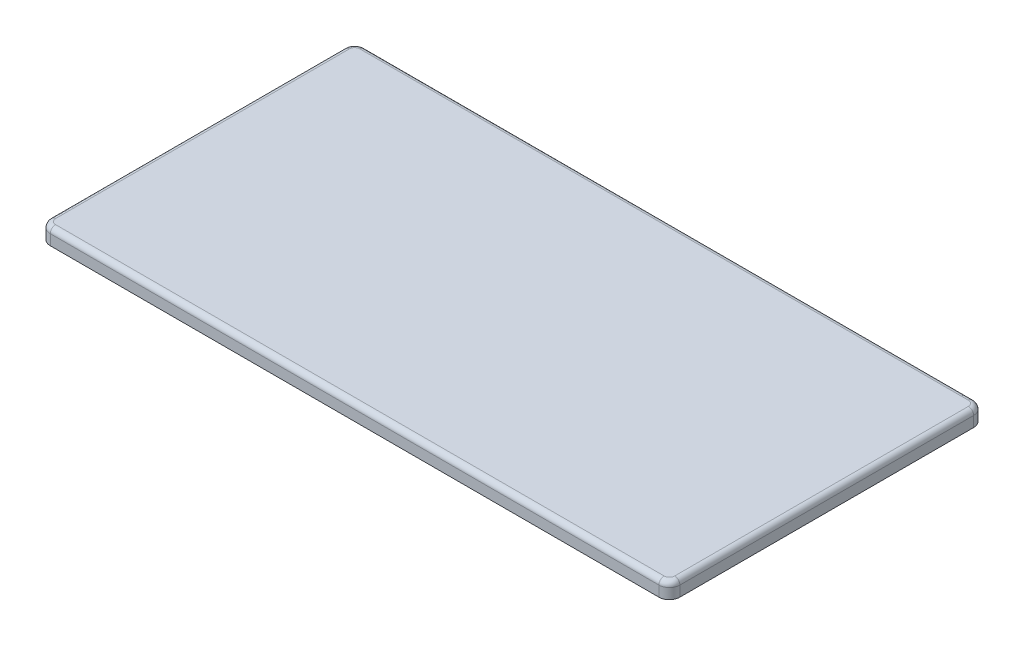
ISO-10303-21;
HEADER;
FILE_DESCRIPTION(('STEP AP214'),'2;1');
FILE_NAME('part.step','',(''),(''),'','','');
FILE_SCHEMA(('AUTOMOTIVE_DESIGN { 1 0 10303 214 1 1 1 1 }'));
ENDSEC;
DATA;
#1=APPLICATION_CONTEXT('core data for automotive mechanical design processes');
#2=APPLICATION_PROTOCOL_DEFINITION('international standard','automotive_design',2000,#1);
#3=PRODUCT_CONTEXT('',#1,'mechanical');
#4=PRODUCT('Part','Part','',(#3));
#5=PRODUCT_RELATED_PRODUCT_CATEGORY('part','',(#4));
#6=PRODUCT_DEFINITION_FORMATION('','',#4);
#7=PRODUCT_DEFINITION_CONTEXT('part definition',#1,'design');
#8=PRODUCT_DEFINITION('design','',#6,#7);
#9=PRODUCT_DEFINITION_SHAPE('','',#8);
#10=(LENGTH_UNIT() NAMED_UNIT(*) SI_UNIT(.MILLI.,.METRE.));
#11=(NAMED_UNIT(*) PLANE_ANGLE_UNIT() SI_UNIT($,.RADIAN.));
#12=(NAMED_UNIT(*) SI_UNIT($,.STERADIAN.) SOLID_ANGLE_UNIT());
#13=UNCERTAINTY_MEASURE_WITH_UNIT(LENGTH_MEASURE(1.E-05),#10,'distance_accuracy_value','');
#14=(GEOMETRIC_REPRESENTATION_CONTEXT(3) GLOBAL_UNCERTAINTY_ASSIGNED_CONTEXT((#13)) GLOBAL_UNIT_ASSIGNED_CONTEXT((#10,
#11,#12)) REPRESENTATION_CONTEXT('',''));
#15=CARTESIAN_POINT('',(0.,0.,0.));
#16=DIRECTION('',(0.,0.,1.));
#17=DIRECTION('',(1.,0.,0.));
#18=AXIS2_PLACEMENT_3D('',#15,#16,#17);
#19=CARTESIAN_POINT('',(-58.,-0.5,28.));
#20=DIRECTION('',(0.,-1.,0.));
#21=DIRECTION('',(0.,0.,-1.));
#22=AXIS2_PLACEMENT_3D('',#19,#20,#21);
#23=PLANE('',#22);
#24=DIRECTION('',(1.,0.,0.));
#25=VECTOR('',#24,1.);
#26=CARTESIAN_POINT('',(12.55,-0.5,14.25));
#27=LINE('',#26,#25);
#28=CARTESIAN_POINT('',(12.55,-0.5,14.25));
#29=VERTEX_POINT('',#28);
#30=CARTESIAN_POINT('',(17.45,-0.5,14.25));
#31=VERTEX_POINT('',#30);
#32=EDGE_CURVE('E498',#29,#31,#27,.T.);
#33=ORIENTED_EDGE('',*,*,#32,.F.);
#34=DIRECTION('',(0.,0.,-1.));
#35=VECTOR('',#34,1.);
#36=CARTESIAN_POINT('',(12.55,-0.5,14.25));
#37=LINE('',#36,#35);
#38=CARTESIAN_POINT('',(12.55,-0.5,17.45));
#39=VERTEX_POINT('',#38);
#40=EDGE_CURVE('E472',#39,#29,#37,.T.);
#41=ORIENTED_EDGE('',*,*,#40,.F.);
#42=DIRECTION('',(-1.,0.,0.));
#43=VECTOR('',#42,1.);
#44=CARTESIAN_POINT('',(12.55,-0.5,17.45));
#45=LINE('',#44,#43);
#46=CARTESIAN_POINT('',(17.45,-0.5,17.45));
#47=VERTEX_POINT('',#46);
#48=EDGE_CURVE('E504',#47,#39,#45,.T.);
#49=ORIENTED_EDGE('',*,*,#48,.F.);
#50=DIRECTION('',(0.,0.,1.));
#51=VECTOR('',#50,1.);
#52=CARTESIAN_POINT('',(17.45,-0.5,14.25));
#53=LINE('',#52,#51);
#54=EDGE_CURVE('E501',#31,#47,#53,.T.);
#55=ORIENTED_EDGE('',*,*,#54,.F.);
#56=EDGE_LOOP('',(#33,#41,#49,#55));
#57=FACE_BOUND('',#56,.T.);
#58=DIRECTION('',(1.,0.,0.));
#59=VECTOR('',#58,1.);
#60=CARTESIAN_POINT('',(-17.45,-0.5,14.25));
#61=LINE('',#60,#59);
#62=CARTESIAN_POINT('',(-17.45,-0.5,14.25));
#63=VERTEX_POINT('',#62);
#64=CARTESIAN_POINT('',(-12.55,-0.5,14.25));
#65=VERTEX_POINT('',#64);
#66=EDGE_CURVE('E538',#63,#65,#61,.T.);
#67=ORIENTED_EDGE('',*,*,#66,.F.);
#68=DIRECTION('',(0.,0.,-1.));
#69=VECTOR('',#68,1.);
#70=CARTESIAN_POINT('',(-17.45,-0.5,17.45));
#71=LINE('',#70,#69);
#72=CARTESIAN_POINT('',(-17.45,-0.5,17.45));
#73=VERTEX_POINT('',#72);
#74=EDGE_CURVE('E530',#73,#63,#71,.T.);
#75=ORIENTED_EDGE('',*,*,#74,.F.);
#76=DIRECTION('',(-1.,0.,0.));
#77=VECTOR('',#76,1.);
#78=CARTESIAN_POINT('',(-17.45,-0.5,17.45));
#79=LINE('',#78,#77);
#80=CARTESIAN_POINT('',(-12.55,-0.5,17.45));
#81=VERTEX_POINT('',#80);
#82=EDGE_CURVE('E544',#81,#73,#79,.T.);
#83=ORIENTED_EDGE('',*,*,#82,.F.);
#84=DIRECTION('',(0.,0.,1.));
#85=VECTOR('',#84,1.);
#86=CARTESIAN_POINT('',(-12.55,-0.5,17.45));
#87=LINE('',#86,#85);
#88=EDGE_CURVE('E541',#65,#81,#87,.T.);
#89=ORIENTED_EDGE('',*,*,#88,.F.);
#90=EDGE_LOOP('',(#67,#75,#83,#89));
#91=FACE_BOUND('',#90,.T.);
#92=DIRECTION('',(1.,0.,0.));
#93=VECTOR('',#92,1.);
#94=CARTESIAN_POINT('',(-47.45,-0.5,-17.45));
#95=LINE('',#94,#93);
#96=CARTESIAN_POINT('',(-47.45,-0.5,-17.45));
#97=VERTEX_POINT('',#96);
#98=CARTESIAN_POINT('',(-42.55,-0.5,-17.45));
#99=VERTEX_POINT('',#98);
#100=EDGE_CURVE('E578',#97,#99,#95,.T.);
#101=ORIENTED_EDGE('',*,*,#100,.F.);
#102=DIRECTION('',(0.,0.,-1.));
#103=VECTOR('',#102,1.);
#104=CARTESIAN_POINT('',(-47.45,-0.5,-14.25));
#105=LINE('',#104,#103);
#106=CARTESIAN_POINT('',(-47.45,-0.5,-14.25));
#107=VERTEX_POINT('',#106);
#108=EDGE_CURVE('E570',#107,#97,#105,.T.);
#109=ORIENTED_EDGE('',*,*,#108,.F.);
#110=DIRECTION('',(-1.,0.,0.));
#111=VECTOR('',#110,1.);
#112=CARTESIAN_POINT('',(-47.45,-0.5,-14.25));
#113=LINE('',#112,#111);
#114=CARTESIAN_POINT('',(-42.55,-0.5,-14.25));
#115=VERTEX_POINT('',#114);
#116=EDGE_CURVE('E584',#115,#107,#113,.T.);
#117=ORIENTED_EDGE('',*,*,#116,.F.);
#118=DIRECTION('',(0.,0.,1.));
#119=VECTOR('',#118,1.);
#120=CARTESIAN_POINT('',(-42.55,-0.5,-14.25));
#121=LINE('',#120,#119);
#122=EDGE_CURVE('E581',#99,#115,#121,.T.);
#123=ORIENTED_EDGE('',*,*,#122,.F.);
#124=EDGE_LOOP('',(#101,#109,#117,#123));
#125=FACE_BOUND('',#124,.T.);
#126=DIRECTION('',(1.,0.,0.));
#127=VECTOR('',#126,1.);
#128=CARTESIAN_POINT('',(-47.45,-0.5,14.25));
#129=LINE('',#128,#127);
#130=CARTESIAN_POINT('',(-47.45,-0.5,14.25));
#131=VERTEX_POINT('',#130);
#132=CARTESIAN_POINT('',(-42.55,-0.5,14.25));
#133=VERTEX_POINT('',#132);
#134=EDGE_CURVE('E618',#131,#133,#129,.T.);
#135=ORIENTED_EDGE('',*,*,#134,.F.);
#136=DIRECTION('',(0.,0.,-1.));
#137=VECTOR('',#136,1.);
#138=CARTESIAN_POINT('',(-47.45,-0.5,17.45));
#139=LINE('',#138,#137);
#140=CARTESIAN_POINT('',(-47.45,-0.5,17.45));
#141=VERTEX_POINT('',#140);
#142=EDGE_CURVE('E610',#141,#131,#139,.T.);
#143=ORIENTED_EDGE('',*,*,#142,.F.);
#144=DIRECTION('',(-1.,0.,0.));
#145=VECTOR('',#144,1.);
#146=CARTESIAN_POINT('',(-47.45,-0.5,17.45));
#147=LINE('',#146,#145);
#148=CARTESIAN_POINT('',(-42.55,-0.5,17.45));
#149=VERTEX_POINT('',#148);
#150=EDGE_CURVE('E624',#149,#141,#147,.T.);
#151=ORIENTED_EDGE('',*,*,#150,.F.);
#152=DIRECTION('',(0.,0.,1.));
#153=VECTOR('',#152,1.);
#154=CARTESIAN_POINT('',(-42.55,-0.5,17.45));
#155=LINE('',#154,#153);
#156=EDGE_CURVE('E621',#133,#149,#155,.T.);
#157=ORIENTED_EDGE('',*,*,#156,.F.);
#158=EDGE_LOOP('',(#135,#143,#151,#157));
#159=FACE_BOUND('',#158,.T.);
#160=CARTESIAN_POINT('',(-58.,-0.5,28.));
#161=DIRECTION('',(0.,-1.,0.));
#162=DIRECTION('',(0.,0.,-1.));
#163=AXIS2_PLACEMENT_3D('',#160,#161,#162);
#164=CIRCLE('',#163,0.199999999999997);
#165=CARTESIAN_POINT('',(-58.,-0.5,28.2));
#166=VERTEX_POINT('',#165);
#167=CARTESIAN_POINT('',(-58.2,-0.5,28.));
#168=VERTEX_POINT('',#167);
#169=EDGE_CURVE('E636',#166,#168,#164,.T.);
#170=ORIENTED_EDGE('',*,*,#169,.T.);
#171=DIRECTION('',(0.,0.,-1.));
#172=VECTOR('',#171,1.);
#173=CARTESIAN_POINT('',(-58.2,-0.5,28.));
#174=LINE('',#173,#172);
#175=CARTESIAN_POINT('',(-58.2,-0.5,-28.));
#176=VERTEX_POINT('',#175);
#177=EDGE_CURVE('E639',#168,#176,#174,.T.);
#178=ORIENTED_EDGE('',*,*,#177,.T.);
#179=CARTESIAN_POINT('',(-58.,-0.5,-28.));
#180=DIRECTION('',(0.,-1.,0.));
#181=DIRECTION('',(0.,0.,-1.));
#182=AXIS2_PLACEMENT_3D('',#179,#180,#181);
#183=CIRCLE('',#182,0.199999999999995);
#184=CARTESIAN_POINT('',(-58.,-0.5,-28.2));
#185=VERTEX_POINT('',#184);
#186=EDGE_CURVE('E643',#176,#185,#183,.T.);
#187=ORIENTED_EDGE('',*,*,#186,.T.);
#188=DIRECTION('',(1.,0.,0.));
#189=VECTOR('',#188,1.);
#190=CARTESIAN_POINT('',(-58.,-0.5,-28.2));
#191=LINE('',#190,#189);
#192=CARTESIAN_POINT('',(58.,-0.5,-28.2));
#193=VERTEX_POINT('',#192);
#194=EDGE_CURVE('E646',#185,#193,#191,.T.);
#195=ORIENTED_EDGE('',*,*,#194,.T.);
#196=CARTESIAN_POINT('',(58.,-0.5,-28.));
#197=DIRECTION('',(0.,-1.,0.));
#198=DIRECTION('',(0.,0.,-1.));
#199=AXIS2_PLACEMENT_3D('',#196,#197,#198);
#200=CIRCLE('',#199,0.200000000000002);
#201=CARTESIAN_POINT('',(58.2,-0.5,-28.));
#202=VERTEX_POINT('',#201);
#203=EDGE_CURVE('E649',#193,#202,#200,.T.);
#204=ORIENTED_EDGE('',*,*,#203,.T.);
#205=DIRECTION('',(0.,0.,1.));
#206=VECTOR('',#205,1.);
#207=CARTESIAN_POINT('',(58.2,-0.5,28.));
#208=LINE('',#207,#206);
#209=CARTESIAN_POINT('',(58.2,-0.5,28.));
#210=VERTEX_POINT('',#209);
#211=EDGE_CURVE('E652',#202,#210,#208,.T.);
#212=ORIENTED_EDGE('',*,*,#211,.T.);
#213=CARTESIAN_POINT('',(58.,-0.5,28.));
#214=DIRECTION('',(0.,-1.,0.));
#215=DIRECTION('',(0.,0.,-1.));
#216=AXIS2_PLACEMENT_3D('',#213,#214,#215);
#217=CIRCLE('',#216,0.200000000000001);
#218=CARTESIAN_POINT('',(58.,-0.5,28.2));
#219=VERTEX_POINT('',#218);
#220=EDGE_CURVE('E655',#210,#219,#217,.T.);
#221=ORIENTED_EDGE('',*,*,#220,.T.);
#222=DIRECTION('',(-1.,0.,0.));
#223=VECTOR('',#222,1.);
#224=CARTESIAN_POINT('',(-58.,-0.5,28.2));
#225=LINE('',#224,#223);
#226=EDGE_CURVE('E658',#219,#166,#225,.T.);
#227=ORIENTED_EDGE('',*,*,#226,.T.);
#228=EDGE_LOOP('',(#170,#178,#187,#195,#204,#212,#221,#227));
#229=FACE_BOUND('',#228,.T.);
#230=DIRECTION('',(1.,0.,0.));
#231=VECTOR('',#230,1.);
#232=CARTESIAN_POINT('',(42.55,-0.5,14.25));
#233=LINE('',#232,#231);
#234=CARTESIAN_POINT('',(42.55,-0.5,14.25));
#235=VERTEX_POINT('',#234);
#236=CARTESIAN_POINT('',(47.45,-0.5,14.25));
#237=VERTEX_POINT('',#236);
#238=EDGE_CURVE('E598',#235,#237,#233,.T.);
#239=ORIENTED_EDGE('',*,*,#238,.F.);
#240=DIRECTION('',(0.,0.,-1.));
#241=VECTOR('',#240,1.);
#242=CARTESIAN_POINT('',(42.55,-0.5,14.25));
#243=LINE('',#242,#241);
#244=CARTESIAN_POINT('',(42.55,-0.5,17.45));
#245=VERTEX_POINT('',#244);
#246=EDGE_CURVE('E590',#245,#235,#243,.T.);
#247=ORIENTED_EDGE('',*,*,#246,.F.);
#248=DIRECTION('',(-1.,0.,0.));
#249=VECTOR('',#248,1.);
#250=CARTESIAN_POINT('',(42.55,-0.5,17.45));
#251=LINE('',#250,#249);
#252=CARTESIAN_POINT('',(47.45,-0.5,17.45));
#253=VERTEX_POINT('',#252);
#254=EDGE_CURVE('E604',#253,#245,#251,.T.);
#255=ORIENTED_EDGE('',*,*,#254,.F.);
#256=DIRECTION('',(0.,0.,1.));
#257=VECTOR('',#256,1.);
#258=CARTESIAN_POINT('',(47.45,-0.5,14.25));
#259=LINE('',#258,#257);
#260=EDGE_CURVE('E601',#237,#253,#259,.T.);
#261=ORIENTED_EDGE('',*,*,#260,.F.);
#262=EDGE_LOOP('',(#239,#247,#255,#261));
#263=FACE_BOUND('',#262,.T.);
#264=DIRECTION('',(1.,0.,0.));
#265=VECTOR('',#264,1.);
#266=CARTESIAN_POINT('',(42.55,-0.5,-17.45));
#267=LINE('',#266,#265);
#268=CARTESIAN_POINT('',(42.55,-0.5,-17.45));
#269=VERTEX_POINT('',#268);
#270=CARTESIAN_POINT('',(47.45,-0.5,-17.45));
#271=VERTEX_POINT('',#270);
#272=EDGE_CURVE('E558',#269,#271,#267,.T.);
#273=ORIENTED_EDGE('',*,*,#272,.F.);
#274=DIRECTION('',(0.,0.,-1.));
#275=VECTOR('',#274,1.);
#276=CARTESIAN_POINT('',(42.55,-0.5,-14.25));
#277=LINE('',#276,#275);
#278=CARTESIAN_POINT('',(42.55,-0.5,-14.25));
#279=VERTEX_POINT('',#278);
#280=EDGE_CURVE('E550',#279,#269,#277,.T.);
#281=ORIENTED_EDGE('',*,*,#280,.F.);
#282=DIRECTION('',(-1.,0.,0.));
#283=VECTOR('',#282,1.);
#284=CARTESIAN_POINT('',(42.55,-0.5,-14.25));
#285=LINE('',#284,#283);
#286=CARTESIAN_POINT('',(47.45,-0.5,-14.25));
#287=VERTEX_POINT('',#286);
#288=EDGE_CURVE('E564',#287,#279,#285,.T.);
#289=ORIENTED_EDGE('',*,*,#288,.F.);
#290=DIRECTION('',(0.,0.,1.));
#291=VECTOR('',#290,1.);
#292=CARTESIAN_POINT('',(47.45,-0.5,-14.25));
#293=LINE('',#292,#291);
#294=EDGE_CURVE('E561',#271,#287,#293,.T.);
#295=ORIENTED_EDGE('',*,*,#294,.F.);
#296=EDGE_LOOP('',(#273,#281,#289,#295));
#297=FACE_BOUND('',#296,.T.);
#298=DIRECTION('',(1.,0.,0.));
#299=VECTOR('',#298,1.);
#300=CARTESIAN_POINT('',(-17.45,-0.5,-17.45));
#301=LINE('',#300,#299);
#302=CARTESIAN_POINT('',(-17.45,-0.5,-17.45));
#303=VERTEX_POINT('',#302);
#304=CARTESIAN_POINT('',(-12.55,-0.5,-17.45));
#305=VERTEX_POINT('',#304);
#306=EDGE_CURVE('E518',#303,#305,#301,.T.);
#307=ORIENTED_EDGE('',*,*,#306,.F.);
#308=DIRECTION('',(0.,0.,-1.));
#309=VECTOR('',#308,1.);
#310=CARTESIAN_POINT('',(-17.45,-0.5,-14.25));
#311=LINE('',#310,#309);
#312=CARTESIAN_POINT('',(-17.45,-0.5,-14.25));
#313=VERTEX_POINT('',#312);
#314=EDGE_CURVE('E510',#313,#303,#311,.T.);
#315=ORIENTED_EDGE('',*,*,#314,.F.);
#316=DIRECTION('',(-1.,0.,0.));
#317=VECTOR('',#316,1.);
#318=CARTESIAN_POINT('',(-17.45,-0.5,-14.25));
#319=LINE('',#318,#317);
#320=CARTESIAN_POINT('',(-12.55,-0.5,-14.25));
#321=VERTEX_POINT('',#320);
#322=EDGE_CURVE('E524',#321,#313,#319,.T.);
#323=ORIENTED_EDGE('',*,*,#322,.F.);
#324=DIRECTION('',(0.,0.,1.));
#325=VECTOR('',#324,1.);
#326=CARTESIAN_POINT('',(-12.55,-0.5,-14.25));
#327=LINE('',#326,#325);
#328=EDGE_CURVE('E521',#305,#321,#327,.T.);
#329=ORIENTED_EDGE('',*,*,#328,.F.);
#330=EDGE_LOOP('',(#307,#315,#323,#329));
#331=FACE_BOUND('',#330,.T.);
#332=DIRECTION('',(1.,0.,0.));
#333=VECTOR('',#332,1.);
#334=CARTESIAN_POINT('',(12.55,-0.5,-17.45));
#335=LINE('',#334,#333);
#336=CARTESIAN_POINT('',(12.55,-0.5,-17.45));
#337=VERTEX_POINT('',#336);
#338=CARTESIAN_POINT('',(17.45,-0.5,-17.45));
#339=VERTEX_POINT('',#338);
#340=EDGE_CURVE('E466',#337,#339,#335,.T.);
#341=ORIENTED_EDGE('',*,*,#340,.F.);
#342=DIRECTION('',(0.,0.,-1.));
#343=VECTOR('',#342,1.);
#344=CARTESIAN_POINT('',(12.55,-0.5,-17.45));
#345=LINE('',#344,#343);
#346=CARTESIAN_POINT('',(12.55,-0.5,-14.25));
#347=VERTEX_POINT('',#346);
#348=EDGE_CURVE('E476',#347,#337,#345,.T.);
#349=ORIENTED_EDGE('',*,*,#348,.F.);
#350=DIRECTION('',(-1.,0.,0.));
#351=VECTOR('',#350,1.);
#352=CARTESIAN_POINT('',(12.55,-0.5,-14.25));
#353=LINE('',#352,#351);
#354=CARTESIAN_POINT('',(17.45,-0.5,-14.25));
#355=VERTEX_POINT('',#354);
#356=EDGE_CURVE('E488',#355,#347,#353,.T.);
#357=ORIENTED_EDGE('',*,*,#356,.F.);
#358=DIRECTION('',(0.,0.,1.));
#359=VECTOR('',#358,1.);
#360=CARTESIAN_POINT('',(17.45,-0.5,-17.45));
#361=LINE('',#360,#359);
#362=EDGE_CURVE('E486',#339,#355,#361,.T.);
#363=ORIENTED_EDGE('',*,*,#362,.F.);
#364=EDGE_LOOP('',(#341,#349,#357,#363));
#365=FACE_BOUND('',#364,.T.);
#366=ADVANCED_FACE('F35',(#57,#91,#125,#159,#229,#263,#297,#331,#365),#23,.T.);
#367=CARTESIAN_POINT('',(-58.,1.5,-28.));
#368=DIRECTION('',(0.,-1.,0.));
#369=DIRECTION('',(0.,0.,-1.));
#370=AXIS2_PLACEMENT_3D('',#367,#368,#369);
#371=CYLINDRICAL_SURFACE('',#370,2.);
#372=DIRECTION('',(0.,-1.,0.));
#373=VECTOR('',#372,1.);
#374=CARTESIAN_POINT('',(-60.,1.5,-28.));
#375=LINE('',#374,#373);
#376=CARTESIAN_POINT('',(-60.,0.5,-28.));
#377=VERTEX_POINT('',#376);
#378=CARTESIAN_POINT('',(-60.,-1.5,-28.));
#379=VERTEX_POINT('',#378);
#380=EDGE_CURVE('E739',#377,#379,#375,.T.);
#381=ORIENTED_EDGE('',*,*,#380,.F.);
#382=CARTESIAN_POINT('',(-58.,0.5,-28.));
#383=DIRECTION('',(0.,1.,0.));
#384=DIRECTION('',(0.,0.,1.));
#385=AXIS2_PLACEMENT_3D('',#382,#383,#384);
#386=CIRCLE('',#385,2.);
#387=CARTESIAN_POINT('',(-58.,0.5,-30.));
#388=VERTEX_POINT('',#387);
#389=EDGE_CURVE('E763',#377,#388,#386,.F.);
#390=ORIENTED_EDGE('',*,*,#389,.T.);
#391=DIRECTION('',(0.,-1.,0.));
#392=VECTOR('',#391,1.);
#393=CARTESIAN_POINT('',(-58.,1.5,-30.));
#394=LINE('',#393,#392);
#395=CARTESIAN_POINT('',(-58.,-1.5,-30.));
#396=VERTEX_POINT('',#395);
#397=EDGE_CURVE('E725',#388,#396,#394,.T.);
#398=ORIENTED_EDGE('',*,*,#397,.T.);
#399=CARTESIAN_POINT('',(-58.,-1.5,-28.));
#400=DIRECTION('',(0.,1.,0.));
#401=DIRECTION('',(0.,0.,1.));
#402=AXIS2_PLACEMENT_3D('',#399,#400,#401);
#403=CIRCLE('',#402,2.);
#404=EDGE_CURVE('E700',#396,#379,#403,.T.);
#405=ORIENTED_EDGE('',*,*,#404,.T.);
#406=EDGE_LOOP('',(#381,#390,#398,#405));
#407=FACE_BOUND('',#406,.T.);
#408=ADVANCED_FACE('F1050',(#407),#371,.T.);
#409=CARTESIAN_POINT('',(-60.,1.5,28.));
#410=DIRECTION('',(1.,0.,0.));
#411=DIRECTION('',(0.,0.,-1.));
#412=AXIS2_PLACEMENT_3D('',#409,#410,#411);
#413=PLANE('',#412);
#414=DIRECTION('',(0.,-1.,0.));
#415=VECTOR('',#414,1.);
#416=CARTESIAN_POINT('',(-60.,1.5,28.));
#417=LINE('',#416,#415);
#418=CARTESIAN_POINT('',(-60.,0.5,28.));
#419=VERTEX_POINT('',#418);
#420=CARTESIAN_POINT('',(-60.,-1.5,28.));
#421=VERTEX_POINT('',#420);
#422=EDGE_CURVE('E737',#419,#421,#417,.T.);
#423=ORIENTED_EDGE('',*,*,#422,.F.);
#424=DIRECTION('',(0.,0.,1.));
#425=VECTOR('',#424,1.);
#426=CARTESIAN_POINT('',(-60.,0.5,-28.));
#427=LINE('',#426,#425);
#428=EDGE_CURVE('E761',#419,#377,#427,.F.);
#429=ORIENTED_EDGE('',*,*,#428,.T.);
#430=ORIENTED_EDGE('',*,*,#380,.T.);
#431=DIRECTION('',(0.,0.,1.));
#432=VECTOR('',#431,1.);
#433=CARTESIAN_POINT('',(-60.,-1.5,28.));
#434=LINE('',#433,#432);
#435=EDGE_CURVE('E703',#379,#421,#434,.T.);
#436=ORIENTED_EDGE('',*,*,#435,.T.);
#437=EDGE_LOOP('',(#423,#429,#430,#436));
#438=FACE_BOUND('',#437,.T.);
#439=ADVANCED_FACE('F1056',(#438),#413,.F.);
#440=CARTESIAN_POINT('',(-58.,1.5,28.));
#441=DIRECTION('',(0.,-1.,0.));
#442=DIRECTION('',(0.,0.,-1.));
#443=AXIS2_PLACEMENT_3D('',#440,#441,#442);
#444=CYLINDRICAL_SURFACE('',#443,2.);
#445=DIRECTION('',(0.,-1.,0.));
#446=VECTOR('',#445,1.);
#447=CARTESIAN_POINT('',(-58.,1.5,30.));
#448=LINE('',#447,#446);
#449=CARTESIAN_POINT('',(-58.,0.5,30.));
#450=VERTEX_POINT('',#449);
#451=CARTESIAN_POINT('',(-58.,-1.5,30.));
#452=VERTEX_POINT('',#451);
#453=EDGE_CURVE('E735',#450,#452,#448,.T.);
#454=ORIENTED_EDGE('',*,*,#453,.F.);
#455=CARTESIAN_POINT('',(-58.,0.5,28.));
#456=DIRECTION('',(0.,1.,0.));
#457=DIRECTION('',(0.,0.,1.));
#458=AXIS2_PLACEMENT_3D('',#455,#456,#457);
#459=CIRCLE('',#458,2.);
#460=EDGE_CURVE('E758',#450,#419,#459,.F.);
#461=ORIENTED_EDGE('',*,*,#460,.T.);
#462=ORIENTED_EDGE('',*,*,#422,.T.);
#463=CARTESIAN_POINT('',(-58.,-1.5,28.));
#464=DIRECTION('',(0.,1.,0.));
#465=DIRECTION('',(0.,0.,1.));
#466=AXIS2_PLACEMENT_3D('',#463,#464,#465);
#467=CIRCLE('',#466,2.);
#468=EDGE_CURVE('E707',#421,#452,#467,.T.);
#469=ORIENTED_EDGE('',*,*,#468,.T.);
#470=EDGE_LOOP('',(#454,#461,#462,#469));
#471=FACE_BOUND('',#470,.T.);
#472=ADVANCED_FACE('F1126',(#471),#444,.T.);
#473=CARTESIAN_POINT('',(-58.,1.5,30.));
#474=DIRECTION('',(0.,0.,-1.));
#475=DIRECTION('',(-1.,0.,0.));
#476=AXIS2_PLACEMENT_3D('',#473,#474,#475);
#477=PLANE('',#476);
#478=DIRECTION('',(0.,-1.,0.));
#479=VECTOR('',#478,1.);
#480=CARTESIAN_POINT('',(58.,1.5,30.));
#481=LINE('',#480,#479);
#482=CARTESIAN_POINT('',(58.,0.5,30.));
#483=VERTEX_POINT('',#482);
#484=CARTESIAN_POINT('',(58.,-1.5,30.));
#485=VERTEX_POINT('',#484);
#486=EDGE_CURVE('E733',#483,#485,#481,.T.);
#487=ORIENTED_EDGE('',*,*,#486,.F.);
#488=DIRECTION('',(1.,0.,0.));
#489=VECTOR('',#488,1.);
#490=CARTESIAN_POINT('',(-58.,0.5,30.));
#491=LINE('',#490,#489);
#492=EDGE_CURVE('E773',#483,#450,#491,.F.);
#493=ORIENTED_EDGE('',*,*,#492,.T.);
#494=ORIENTED_EDGE('',*,*,#453,.T.);
#495=DIRECTION('',(1.,0.,0.));
#496=VECTOR('',#495,1.);
#497=CARTESIAN_POINT('',(-58.,-1.5,30.));
#498=LINE('',#497,#496);
#499=EDGE_CURVE('E710',#452,#485,#498,.T.);
#500=ORIENTED_EDGE('',*,*,#499,.T.);
#501=EDGE_LOOP('',(#487,#493,#494,#500));
#502=FACE_BOUND('',#501,.T.);
#503=ADVANCED_FACE('F1122',(#502),#477,.F.);
#504=CARTESIAN_POINT('',(58.,1.5,28.));
#505=DIRECTION('',(0.,-1.,0.));
#506=DIRECTION('',(0.,0.,-1.));
#507=AXIS2_PLACEMENT_3D('',#504,#505,#506);
#508=CYLINDRICAL_SURFACE('',#507,2.);
#509=DIRECTION('',(0.,-1.,0.));
#510=VECTOR('',#509,1.);
#511=CARTESIAN_POINT('',(60.,1.5,28.));
#512=LINE('',#511,#510);
#513=CARTESIAN_POINT('',(60.,0.5,28.));
#514=VERTEX_POINT('',#513);
#515=CARTESIAN_POINT('',(60.,-1.5,28.));
#516=VERTEX_POINT('',#515);
#517=EDGE_CURVE('E731',#514,#516,#512,.T.);
#518=ORIENTED_EDGE('',*,*,#517,.F.);
#519=CARTESIAN_POINT('',(58.,0.5,28.));
#520=DIRECTION('',(0.,1.,0.));
#521=DIRECTION('',(0.,0.,1.));
#522=AXIS2_PLACEMENT_3D('',#519,#520,#521);
#523=CIRCLE('',#522,2.);
#524=EDGE_CURVE('E771',#514,#483,#523,.F.);
#525=ORIENTED_EDGE('',*,*,#524,.T.);
#526=ORIENTED_EDGE('',*,*,#486,.T.);
#527=CARTESIAN_POINT('',(58.,-1.5,28.));
#528=DIRECTION('',(0.,1.,0.));
#529=DIRECTION('',(0.,0.,1.));
#530=AXIS2_PLACEMENT_3D('',#527,#528,#529);
#531=CIRCLE('',#530,2.);
#532=EDGE_CURVE('E713',#485,#516,#531,.T.);
#533=ORIENTED_EDGE('',*,*,#532,.T.);
#534=EDGE_LOOP('',(#518,#525,#526,#533));
#535=FACE_BOUND('',#534,.T.);
#536=ADVANCED_FACE('F1118',(#535),#508,.T.);
#537=CARTESIAN_POINT('',(60.,1.5,28.));
#538=DIRECTION('',(-1.,0.,0.));
#539=DIRECTION('',(0.,0.,1.));
#540=AXIS2_PLACEMENT_3D('',#537,#538,#539);
#541=PLANE('',#540);
#542=DIRECTION('',(0.,-1.,0.));
#543=VECTOR('',#542,1.);
#544=CARTESIAN_POINT('',(60.,1.5,-28.));
#545=LINE('',#544,#543);
#546=CARTESIAN_POINT('',(60.,0.5,-28.));
#547=VERTEX_POINT('',#546);
#548=CARTESIAN_POINT('',(60.,-1.5,-28.));
#549=VERTEX_POINT('',#548);
#550=EDGE_CURVE('E729',#547,#549,#545,.T.);
#551=ORIENTED_EDGE('',*,*,#550,.F.);
#552=DIRECTION('',(0.,0.,-1.));
#553=VECTOR('',#552,1.);
#554=CARTESIAN_POINT('',(60.,0.5,28.));
#555=LINE('',#554,#553);
#556=EDGE_CURVE('E769',#547,#514,#555,.F.);
#557=ORIENTED_EDGE('',*,*,#556,.T.);
#558=ORIENTED_EDGE('',*,*,#517,.T.);
#559=DIRECTION('',(0.,0.,-1.));
#560=VECTOR('',#559,1.);
#561=CARTESIAN_POINT('',(60.,-1.5,28.));
#562=LINE('',#561,#560);
#563=EDGE_CURVE('E716',#516,#549,#562,.T.);
#564=ORIENTED_EDGE('',*,*,#563,.T.);
#565=EDGE_LOOP('',(#551,#557,#558,#564));
#566=FACE_BOUND('',#565,.T.);
#567=ADVANCED_FACE('F1114',(#566),#541,.F.);
#568=CARTESIAN_POINT('',(58.,1.5,-28.));
#569=DIRECTION('',(0.,-1.,0.));
#570=DIRECTION('',(0.,0.,-1.));
#571=AXIS2_PLACEMENT_3D('',#568,#569,#570);
#572=CYLINDRICAL_SURFACE('',#571,2.);
#573=DIRECTION('',(0.,-1.,0.));
#574=VECTOR('',#573,1.);
#575=CARTESIAN_POINT('',(58.,1.5,-30.));
#576=LINE('',#575,#574);
#577=CARTESIAN_POINT('',(58.,0.5,-30.));
#578=VERTEX_POINT('',#577);
#579=CARTESIAN_POINT('',(58.,-1.5,-30.));
#580=VERTEX_POINT('',#579);
#581=EDGE_CURVE('E727',#578,#580,#576,.T.);
#582=ORIENTED_EDGE('',*,*,#581,.F.);
#583=CARTESIAN_POINT('',(58.,0.5,-28.));
#584=DIRECTION('',(0.,1.,0.));
#585=DIRECTION('',(0.,0.,1.));
#586=AXIS2_PLACEMENT_3D('',#583,#584,#585);
#587=CIRCLE('',#586,2.);
#588=EDGE_CURVE('E767',#578,#547,#587,.F.);
#589=ORIENTED_EDGE('',*,*,#588,.T.);
#590=ORIENTED_EDGE('',*,*,#550,.T.);
#591=CARTESIAN_POINT('',(58.,-1.5,-28.));
#592=DIRECTION('',(0.,1.,0.));
#593=DIRECTION('',(0.,0.,1.));
#594=AXIS2_PLACEMENT_3D('',#591,#592,#593);
#595=CIRCLE('',#594,2.);
#596=EDGE_CURVE('E719',#549,#580,#595,.T.);
#597=ORIENTED_EDGE('',*,*,#596,.T.);
#598=EDGE_LOOP('',(#582,#589,#590,#597));
#599=FACE_BOUND('',#598,.T.);
#600=ADVANCED_FACE('F1110',(#599),#572,.T.);
#601=CARTESIAN_POINT('',(-58.,1.5,-30.));
#602=DIRECTION('',(0.,0.,1.));
#603=DIRECTION('',(1.,0.,0.));
#604=AXIS2_PLACEMENT_3D('',#601,#602,#603);
#605=PLANE('',#604);
#606=ORIENTED_EDGE('',*,*,#397,.F.);
#607=DIRECTION('',(-1.,0.,0.));
#608=VECTOR('',#607,1.);
#609=CARTESIAN_POINT('',(58.,0.5,-30.));
#610=LINE('',#609,#608);
#611=EDGE_CURVE('E765',#388,#578,#610,.F.);
#612=ORIENTED_EDGE('',*,*,#611,.T.);
#613=ORIENTED_EDGE('',*,*,#581,.T.);
#614=DIRECTION('',(-1.,0.,0.));
#615=VECTOR('',#614,1.);
#616=CARTESIAN_POINT('',(-58.,-1.5,-30.));
#617=LINE('',#616,#615);
#618=EDGE_CURVE('E722',#580,#396,#617,.T.);
#619=ORIENTED_EDGE('',*,*,#618,.T.);
#620=EDGE_LOOP('',(#606,#612,#613,#619));
#621=FACE_BOUND('',#620,.T.);
#622=ADVANCED_FACE('F1102',(#621),#605,.F.);
#623=CARTESIAN_POINT('',(-58.,1.5,-28.));
#624=DIRECTION('',(0.,1.,0.));
#625=DIRECTION('',(0.,0.,1.));
#626=AXIS2_PLACEMENT_3D('',#623,#624,#625);
#627=PLANE('',#626);
#628=DIRECTION('',(0.,0.,1.));
#629=VECTOR('',#628,1.);
#630=CARTESIAN_POINT('',(-59.,1.5,28.));
#631=LINE('',#630,#629);
#632=CARTESIAN_POINT('',(-59.,1.5,-28.));
#633=VERTEX_POINT('',#632);
#634=CARTESIAN_POINT('',(-59.,1.5,28.));
#635=VERTEX_POINT('',#634);
#636=EDGE_CURVE('E753',#633,#635,#631,.T.);
#637=ORIENTED_EDGE('',*,*,#636,.T.);
#638=CARTESIAN_POINT('',(-58.,1.5,28.));
#639=DIRECTION('',(0.,1.,0.));
#640=DIRECTION('',(0.,0.,1.));
#641=AXIS2_PLACEMENT_3D('',#638,#639,#640);
#642=CIRCLE('',#641,1.);
#643=CARTESIAN_POINT('',(-58.,1.5,29.));
#644=VERTEX_POINT('',#643);
#645=EDGE_CURVE('E755',#635,#644,#642,.T.);
#646=ORIENTED_EDGE('',*,*,#645,.T.);
#647=DIRECTION('',(1.,0.,0.));
#648=VECTOR('',#647,1.);
#649=CARTESIAN_POINT('',(58.,1.5,29.));
#650=LINE('',#649,#648);
#651=CARTESIAN_POINT('',(58.,1.5,29.));
#652=VERTEX_POINT('',#651);
#653=EDGE_CURVE('E741',#644,#652,#650,.T.);
#654=ORIENTED_EDGE('',*,*,#653,.T.);
#655=CARTESIAN_POINT('',(58.,1.5,28.));
#656=DIRECTION('',(0.,1.,0.));
#657=DIRECTION('',(0.,0.,1.));
#658=AXIS2_PLACEMENT_3D('',#655,#656,#657);
#659=CIRCLE('',#658,1.);
#660=CARTESIAN_POINT('',(59.,1.5,28.));
#661=VERTEX_POINT('',#660);
#662=EDGE_CURVE('E743',#652,#661,#659,.T.);
#663=ORIENTED_EDGE('',*,*,#662,.T.);
#664=DIRECTION('',(0.,0.,-1.));
#665=VECTOR('',#664,1.);
#666=CARTESIAN_POINT('',(59.,1.5,-28.));
#667=LINE('',#666,#665);
#668=CARTESIAN_POINT('',(59.,1.5,-28.));
#669=VERTEX_POINT('',#668);
#670=EDGE_CURVE('E745',#661,#669,#667,.T.);
#671=ORIENTED_EDGE('',*,*,#670,.T.);
#672=CARTESIAN_POINT('',(58.,1.5,-28.));
#673=DIRECTION('',(0.,1.,0.));
#674=DIRECTION('',(0.,0.,1.));
#675=AXIS2_PLACEMENT_3D('',#672,#673,#674);
#676=CIRCLE('',#675,1.);
#677=CARTESIAN_POINT('',(58.,1.5,-29.));
#678=VERTEX_POINT('',#677);
#679=EDGE_CURVE('E747',#669,#678,#676,.T.);
#680=ORIENTED_EDGE('',*,*,#679,.T.);
#681=DIRECTION('',(-1.,0.,0.));
#682=VECTOR('',#681,1.);
#683=CARTESIAN_POINT('',(-58.,1.5,-29.));
#684=LINE('',#683,#682);
#685=CARTESIAN_POINT('',(-58.,1.5,-29.));
#686=VERTEX_POINT('',#685);
#687=EDGE_CURVE('E749',#678,#686,#684,.T.);
#688=ORIENTED_EDGE('',*,*,#687,.T.);
#689=CARTESIAN_POINT('',(-58.,1.5,-28.));
#690=DIRECTION('',(0.,1.,0.));
#691=DIRECTION('',(0.,0.,1.));
#692=AXIS2_PLACEMENT_3D('',#689,#690,#691);
#693=CIRCLE('',#692,1.);
#694=EDGE_CURVE('E751',#686,#633,#693,.T.);
#695=ORIENTED_EDGE('',*,*,#694,.T.);
#696=EDGE_LOOP('',(#637,#646,#654,#663,#671,#680,#688,#695));
#697=FACE_BOUND('',#696,.T.);
#698=ADVANCED_FACE('F1098',(#697),#627,.T.);
#699=CARTESIAN_POINT('',(-58.,-1.5,-28.));
#700=DIRECTION('',(0.,1.,0.));
#701=DIRECTION('',(0.,0.,1.));
#702=AXIS2_PLACEMENT_3D('',#699,#700,#701);
#703=PLANE('',#702);
#704=DIRECTION('',(0.,0.,-1.));
#705=VECTOR('',#704,1.);
#706=CARTESIAN_POINT('',(-58.2,-1.5,28.));
#707=LINE('',#706,#705);
#708=CARTESIAN_POINT('',(-58.2,-1.5,28.));
#709=VERTEX_POINT('',#708);
#710=CARTESIAN_POINT('',(-58.2,-1.5,-28.));
#711=VERTEX_POINT('',#710);
#712=EDGE_CURVE('E663',#709,#711,#707,.T.);
#713=ORIENTED_EDGE('',*,*,#712,.F.);
#714=CARTESIAN_POINT('',(-58.,-1.5,28.));
#715=DIRECTION('',(0.,-1.,0.));
#716=DIRECTION('',(0.,0.,-1.));
#717=AXIS2_PLACEMENT_3D('',#714,#715,#716);
#718=CIRCLE('',#717,0.199999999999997);
#719=CARTESIAN_POINT('',(-58.,-1.5,28.2));
#720=VERTEX_POINT('',#719);
#721=EDGE_CURVE('E630',#720,#709,#718,.T.);
#722=ORIENTED_EDGE('',*,*,#721,.F.);
#723=DIRECTION('',(-1.,0.,0.));
#724=VECTOR('',#723,1.);
#725=CARTESIAN_POINT('',(-58.,-1.5,28.2));
#726=LINE('',#725,#724);
#727=CARTESIAN_POINT('',(58.,-1.5,28.2));
#728=VERTEX_POINT('',#727);
#729=EDGE_CURVE('E640',#728,#720,#726,.T.);
#730=ORIENTED_EDGE('',*,*,#729,.F.);
#731=CARTESIAN_POINT('',(58.,-1.5,28.));
#732=DIRECTION('',(0.,-1.,0.));
#733=DIRECTION('',(0.,0.,-1.));
#734=AXIS2_PLACEMENT_3D('',#731,#732,#733);
#735=CIRCLE('',#734,0.200000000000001);
#736=CARTESIAN_POINT('',(58.2,-1.5,28.));
#737=VERTEX_POINT('',#736);
#738=EDGE_CURVE('E678',#737,#728,#735,.T.);
#739=ORIENTED_EDGE('',*,*,#738,.F.);
#740=DIRECTION('',(0.,0.,1.));
#741=VECTOR('',#740,1.);
#742=CARTESIAN_POINT('',(58.2,-1.5,28.));
#743=LINE('',#742,#741);
#744=CARTESIAN_POINT('',(58.2,-1.5,-28.));
#745=VERTEX_POINT('',#744);
#746=EDGE_CURVE('E675',#745,#737,#743,.T.);
#747=ORIENTED_EDGE('',*,*,#746,.F.);
#748=CARTESIAN_POINT('',(58.,-1.5,-28.));
#749=DIRECTION('',(0.,-1.,0.));
#750=DIRECTION('',(0.,0.,-1.));
#751=AXIS2_PLACEMENT_3D('',#748,#749,#750);
#752=CIRCLE('',#751,0.200000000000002);
#753=CARTESIAN_POINT('',(58.,-1.5,-28.2));
#754=VERTEX_POINT('',#753);
#755=EDGE_CURVE('E672',#754,#745,#752,.T.);
#756=ORIENTED_EDGE('',*,*,#755,.F.);
#757=DIRECTION('',(1.,0.,0.));
#758=VECTOR('',#757,1.);
#759=CARTESIAN_POINT('',(-58.,-1.5,-28.2));
#760=LINE('',#759,#758);
#761=CARTESIAN_POINT('',(-58.,-1.5,-28.2));
#762=VERTEX_POINT('',#761);
#763=EDGE_CURVE('E669',#762,#754,#760,.T.);
#764=ORIENTED_EDGE('',*,*,#763,.F.);
#765=CARTESIAN_POINT('',(-58.,-1.5,-28.));
#766=DIRECTION('',(0.,-1.,0.));
#767=DIRECTION('',(0.,0.,-1.));
#768=AXIS2_PLACEMENT_3D('',#765,#766,#767);
#769=CIRCLE('',#768,0.199999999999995);
#770=EDGE_CURVE('E666',#711,#762,#769,.T.);
#771=ORIENTED_EDGE('',*,*,#770,.F.);
#772=EDGE_LOOP('',(#713,#722,#730,#739,#747,#756,#764,#771));
#773=FACE_BOUND('',#772,.T.);
#774=ORIENTED_EDGE('',*,*,#404,.F.);
#775=ORIENTED_EDGE('',*,*,#618,.F.);
#776=ORIENTED_EDGE('',*,*,#596,.F.);
#777=ORIENTED_EDGE('',*,*,#563,.F.);
#778=ORIENTED_EDGE('',*,*,#532,.F.);
#779=ORIENTED_EDGE('',*,*,#499,.F.);
#780=ORIENTED_EDGE('',*,*,#468,.F.);
#781=ORIENTED_EDGE('',*,*,#435,.F.);
#782=EDGE_LOOP('',(#774,#775,#776,#777,#778,#779,#780,#781));
#783=FACE_BOUND('',#782,.T.);
#784=ADVANCED_FACE('F1101',(#773,#783),#703,.F.);
#785=CARTESIAN_POINT('',(58.,0.5,-28.));
#786=DIRECTION('',(0.,1.,0.));
#787=DIRECTION('',(0.,0.,1.));
#788=AXIS2_PLACEMENT_3D('',#785,#786,#787);
#789=TOROIDAL_SURFACE('',#788,1.,1.);
#790=CARTESIAN_POINT('',(59.,0.5,-28.));
#791=DIRECTION('',(0.,0.,1.));
#792=DIRECTION('',(1.,0.,0.));
#793=AXIS2_PLACEMENT_3D('',#790,#791,#792);
#794=CIRCLE('',#793,1.);
#795=EDGE_CURVE('E791',#547,#669,#794,.T.);
#796=ORIENTED_EDGE('',*,*,#795,.F.);
#797=ORIENTED_EDGE('',*,*,#588,.F.);
#798=CARTESIAN_POINT('',(58.,0.5,-29.));
#799=DIRECTION('',(-1.,0.,0.));
#800=DIRECTION('',(0.,0.,1.));
#801=AXIS2_PLACEMENT_3D('',#798,#799,#800);
#802=CIRCLE('',#801,1.);
#803=EDGE_CURVE('E704',#678,#578,#802,.T.);
#804=ORIENTED_EDGE('',*,*,#803,.F.);
#805=ORIENTED_EDGE('',*,*,#679,.F.);
#806=EDGE_LOOP('',(#796,#797,#804,#805));
#807=FACE_BOUND('',#806,.T.);
#808=ADVANCED_FACE('F1106',(#807),#789,.T.);
#809=CARTESIAN_POINT('',(-58.,0.5,-29.));
#810=DIRECTION('',(1.,0.,0.));
#811=DIRECTION('',(0.,0.,-1.));
#812=AXIS2_PLACEMENT_3D('',#809,#810,#811);
#813=CYLINDRICAL_SURFACE('',#812,1.);
#814=ORIENTED_EDGE('',*,*,#803,.T.);
#815=ORIENTED_EDGE('',*,*,#611,.F.);
#816=CARTESIAN_POINT('',(-58.,0.5,-29.));
#817=DIRECTION('',(-1.,0.,0.));
#818=DIRECTION('',(0.,0.,1.));
#819=AXIS2_PLACEMENT_3D('',#816,#817,#818);
#820=CIRCLE('',#819,1.);
#821=EDGE_CURVE('E788',#686,#388,#820,.T.);
#822=ORIENTED_EDGE('',*,*,#821,.F.);
#823=ORIENTED_EDGE('',*,*,#687,.F.);
#824=EDGE_LOOP('',(#814,#815,#822,#823));
#825=FACE_BOUND('',#824,.T.);
#826=ADVANCED_FACE('F1156',(#825),#813,.T.);
#827=CARTESIAN_POINT('',(59.,0.5,-28.));
#828=DIRECTION('',(0.,0.,1.));
#829=DIRECTION('',(1.,0.,0.));
#830=AXIS2_PLACEMENT_3D('',#827,#828,#829);
#831=CYLINDRICAL_SURFACE('',#830,1.);
#832=ORIENTED_EDGE('',*,*,#795,.T.);
#833=ORIENTED_EDGE('',*,*,#670,.F.);
#834=CARTESIAN_POINT('',(59.,0.5,28.));
#835=DIRECTION('',(0.,0.,1.));
#836=DIRECTION('',(1.,0.,0.));
#837=AXIS2_PLACEMENT_3D('',#834,#835,#836);
#838=CIRCLE('',#837,1.);
#839=EDGE_CURVE('E785',#514,#661,#838,.T.);
#840=ORIENTED_EDGE('',*,*,#839,.F.);
#841=ORIENTED_EDGE('',*,*,#556,.F.);
#842=EDGE_LOOP('',(#832,#833,#840,#841));
#843=FACE_BOUND('',#842,.T.);
#844=ADVANCED_FACE('F1152',(#843),#831,.T.);
#845=CARTESIAN_POINT('',(-58.,0.5,-28.));
#846=DIRECTION('',(0.,1.,0.));
#847=DIRECTION('',(0.,0.,1.));
#848=AXIS2_PLACEMENT_3D('',#845,#846,#847);
#849=DEGENERATE_TOROIDAL_SURFACE('',#848,1.,1.,.T.);
#850=ORIENTED_EDGE('',*,*,#821,.T.);
#851=ORIENTED_EDGE('',*,*,#389,.F.);
#852=CARTESIAN_POINT('',(-59.,0.5,-28.));
#853=DIRECTION('',(0.,0.,1.));
#854=DIRECTION('',(1.,0.,0.));
#855=AXIS2_PLACEMENT_3D('',#852,#853,#854);
#856=CIRCLE('',#855,1.);
#857=EDGE_CURVE('E782',#633,#377,#856,.T.);
#858=ORIENTED_EDGE('',*,*,#857,.F.);
#859=ORIENTED_EDGE('',*,*,#694,.F.);
#860=EDGE_LOOP('',(#850,#851,#858,#859));
#861=FACE_BOUND('',#860,.T.);
#862=ADVANCED_FACE('F1148',(#861),#849,.T.);
#863=CARTESIAN_POINT('',(58.,0.5,28.));
#864=DIRECTION('',(0.,1.,0.));
#865=DIRECTION('',(0.,0.,1.));
#866=AXIS2_PLACEMENT_3D('',#863,#864,#865);
#867=DEGENERATE_TOROIDAL_SURFACE('',#866,1.,1.,.T.);
#868=ORIENTED_EDGE('',*,*,#839,.T.);
#869=ORIENTED_EDGE('',*,*,#662,.F.);
#870=CARTESIAN_POINT('',(58.,0.5,29.));
#871=DIRECTION('',(-1.,0.,0.));
#872=DIRECTION('',(0.,0.,1.));
#873=AXIS2_PLACEMENT_3D('',#870,#871,#872);
#874=CIRCLE('',#873,1.);
#875=EDGE_CURVE('E779',#483,#652,#874,.T.);
#876=ORIENTED_EDGE('',*,*,#875,.F.);
#877=ORIENTED_EDGE('',*,*,#524,.F.);
#878=EDGE_LOOP('',(#868,#869,#876,#877));
#879=FACE_BOUND('',#878,.T.);
#880=ADVANCED_FACE('F1144',(#879),#867,.T.);
#881=CARTESIAN_POINT('',(-59.,0.5,-28.));
#882=DIRECTION('',(0.,0.,-1.));
#883=DIRECTION('',(-1.,0.,0.));
#884=AXIS2_PLACEMENT_3D('',#881,#882,#883);
#885=CYLINDRICAL_SURFACE('',#884,1.);
#886=ORIENTED_EDGE('',*,*,#857,.T.);
#887=ORIENTED_EDGE('',*,*,#428,.F.);
#888=CARTESIAN_POINT('',(-59.,0.5,28.));
#889=DIRECTION('',(0.,0.,1.));
#890=DIRECTION('',(1.,0.,0.));
#891=AXIS2_PLACEMENT_3D('',#888,#889,#890);
#892=CIRCLE('',#891,1.);
#893=EDGE_CURVE('E777',#635,#419,#892,.T.);
#894=ORIENTED_EDGE('',*,*,#893,.F.);
#895=ORIENTED_EDGE('',*,*,#636,.F.);
#896=EDGE_LOOP('',(#886,#887,#894,#895));
#897=FACE_BOUND('',#896,.T.);
#898=ADVANCED_FACE('F1140',(#897),#885,.T.);
#899=CARTESIAN_POINT('',(-58.,0.5,29.));
#900=DIRECTION('',(-1.,0.,0.));
#901=DIRECTION('',(0.,0.,1.));
#902=AXIS2_PLACEMENT_3D('',#899,#900,#901);
#903=CYLINDRICAL_SURFACE('',#902,1.);
#904=ORIENTED_EDGE('',*,*,#875,.T.);
#905=ORIENTED_EDGE('',*,*,#653,.F.);
#906=CARTESIAN_POINT('',(-58.,0.5,29.));
#907=DIRECTION('',(-1.,0.,0.));
#908=DIRECTION('',(0.,0.,1.));
#909=AXIS2_PLACEMENT_3D('',#906,#907,#908);
#910=CIRCLE('',#909,1.);
#911=EDGE_CURVE('E685',#450,#644,#910,.T.);
#912=ORIENTED_EDGE('',*,*,#911,.F.);
#913=ORIENTED_EDGE('',*,*,#492,.F.);
#914=EDGE_LOOP('',(#904,#905,#912,#913));
#915=FACE_BOUND('',#914,.T.);
#916=ADVANCED_FACE('F1136',(#915),#903,.T.);
#917=CARTESIAN_POINT('',(-58.,0.5,28.));
#918=DIRECTION('',(0.,1.,0.));
#919=DIRECTION('',(0.,0.,1.));
#920=AXIS2_PLACEMENT_3D('',#917,#918,#919);
#921=TOROIDAL_SURFACE('',#920,1.,1.);
#922=ORIENTED_EDGE('',*,*,#893,.T.);
#923=ORIENTED_EDGE('',*,*,#460,.F.);
#924=ORIENTED_EDGE('',*,*,#911,.T.);
#925=ORIENTED_EDGE('',*,*,#645,.F.);
#926=EDGE_LOOP('',(#922,#923,#924,#925));
#927=FACE_BOUND('',#926,.T.);
#928=ADVANCED_FACE('F1096',(#927),#921,.T.);
#929=CARTESIAN_POINT('',(-58.,-0.5,28.));
#930=DIRECTION('',(0.,-1.,0.));
#931=DIRECTION('',(0.,0.,-1.));
#932=AXIS2_PLACEMENT_3D('',#929,#930,#931);
#933=CYLINDRICAL_SURFACE('',#932,0.199999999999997);
#934=ORIENTED_EDGE('',*,*,#721,.T.);
#935=DIRECTION('',(0.,-1.,0.));
#936=VECTOR('',#935,1.);
#937=CARTESIAN_POINT('',(-58.2,-0.5,28.));
#938=LINE('',#937,#936);
#939=EDGE_CURVE('E661',#168,#709,#938,.T.);
#940=ORIENTED_EDGE('',*,*,#939,.F.);
#941=ORIENTED_EDGE('',*,*,#169,.F.);
#942=DIRECTION('',(0.,-1.,0.));
#943=VECTOR('',#942,1.);
#944=CARTESIAN_POINT('',(-58.,-0.5,28.2));
#945=LINE('',#944,#943);
#946=EDGE_CURVE('E683',#166,#720,#945,.T.);
#947=ORIENTED_EDGE('',*,*,#946,.T.);
#948=EDGE_LOOP('',(#934,#940,#941,#947));
#949=FACE_BOUND('',#948,.T.);
#950=ADVANCED_FACE('F1069',(#949),#933,.F.);
#951=CARTESIAN_POINT('',(-58.,-0.5,28.2));
#952=DIRECTION('',(0.,0.,1.));
#953=DIRECTION('',(1.,0.,0.));
#954=AXIS2_PLACEMENT_3D('',#951,#952,#953);
#955=PLANE('',#954);
#956=ORIENTED_EDGE('',*,*,#729,.T.);
#957=ORIENTED_EDGE('',*,*,#946,.F.);
#958=ORIENTED_EDGE('',*,*,#226,.F.);
#959=DIRECTION('',(0.,-1.,0.));
#960=VECTOR('',#959,1.);
#961=CARTESIAN_POINT('',(58.,-0.5,28.2));
#962=LINE('',#961,#960);
#963=EDGE_CURVE('E686',#219,#728,#962,.T.);
#964=ORIENTED_EDGE('',*,*,#963,.T.);
#965=EDGE_LOOP('',(#956,#957,#958,#964));
#966=FACE_BOUND('',#965,.T.);
#967=ADVANCED_FACE('F1065',(#966),#955,.F.);
#968=CARTESIAN_POINT('',(58.,-0.5,28.));
#969=DIRECTION('',(0.,-1.,0.));
#970=DIRECTION('',(0.,0.,-1.));
#971=AXIS2_PLACEMENT_3D('',#968,#969,#970);
#972=CYLINDRICAL_SURFACE('',#971,0.200000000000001);
#973=ORIENTED_EDGE('',*,*,#738,.T.);
#974=ORIENTED_EDGE('',*,*,#963,.F.);
#975=ORIENTED_EDGE('',*,*,#220,.F.);
#976=DIRECTION('',(0.,-1.,0.));
#977=VECTOR('',#976,1.);
#978=CARTESIAN_POINT('',(58.2,-0.5,28.));
#979=LINE('',#978,#977);
#980=EDGE_CURVE('E688',#210,#737,#979,.T.);
#981=ORIENTED_EDGE('',*,*,#980,.T.);
#982=EDGE_LOOP('',(#973,#974,#975,#981));
#983=FACE_BOUND('',#982,.T.);
#984=ADVANCED_FACE('F1068',(#983),#972,.F.);
#985=CARTESIAN_POINT('',(58.2,-0.5,28.));
#986=DIRECTION('',(1.,0.,0.));
#987=DIRECTION('',(0.,0.,-1.));
#988=AXIS2_PLACEMENT_3D('',#985,#986,#987);
#989=PLANE('',#988);
#990=ORIENTED_EDGE('',*,*,#746,.T.);
#991=ORIENTED_EDGE('',*,*,#980,.F.);
#992=ORIENTED_EDGE('',*,*,#211,.F.);
#993=DIRECTION('',(0.,-1.,0.));
#994=VECTOR('',#993,1.);
#995=CARTESIAN_POINT('',(58.2,-0.5,-28.));
#996=LINE('',#995,#994);
#997=EDGE_CURVE('E690',#202,#745,#996,.T.);
#998=ORIENTED_EDGE('',*,*,#997,.T.);
#999=EDGE_LOOP('',(#990,#991,#992,#998));
#1000=FACE_BOUND('',#999,.T.);
#1001=ADVANCED_FACE('F1073',(#1000),#989,.F.);
#1002=CARTESIAN_POINT('',(58.,-0.5,-28.));
#1003=DIRECTION('',(0.,-1.,0.));
#1004=DIRECTION('',(0.,0.,-1.));
#1005=AXIS2_PLACEMENT_3D('',#1002,#1003,#1004);
#1006=CYLINDRICAL_SURFACE('',#1005,0.200000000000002);
#1007=ORIENTED_EDGE('',*,*,#755,.T.);
#1008=ORIENTED_EDGE('',*,*,#997,.F.);
#1009=ORIENTED_EDGE('',*,*,#203,.F.);
#1010=DIRECTION('',(0.,-1.,0.));
#1011=VECTOR('',#1010,1.);
#1012=CARTESIAN_POINT('',(58.,-0.5,-28.2));
#1013=LINE('',#1012,#1011);
#1014=EDGE_CURVE('E692',#193,#754,#1013,.T.);
#1015=ORIENTED_EDGE('',*,*,#1014,.T.);
#1016=EDGE_LOOP('',(#1007,#1008,#1009,#1015));
#1017=FACE_BOUND('',#1016,.T.);
#1018=ADVANCED_FACE('F1077',(#1017),#1006,.F.);
#1019=CARTESIAN_POINT('',(-58.,-0.5,-28.2));
#1020=DIRECTION('',(0.,0.,-1.));
#1021=DIRECTION('',(-1.,0.,0.));
#1022=AXIS2_PLACEMENT_3D('',#1019,#1020,#1021);
#1023=PLANE('',#1022);
#1024=ORIENTED_EDGE('',*,*,#763,.T.);
#1025=ORIENTED_EDGE('',*,*,#1014,.F.);
#1026=ORIENTED_EDGE('',*,*,#194,.F.);
#1027=DIRECTION('',(0.,-1.,0.));
#1028=VECTOR('',#1027,1.);
#1029=CARTESIAN_POINT('',(-58.,-0.5,-28.2));
#1030=LINE('',#1029,#1028);
#1031=EDGE_CURVE('E694',#185,#762,#1030,.T.);
#1032=ORIENTED_EDGE('',*,*,#1031,.T.);
#1033=EDGE_LOOP('',(#1024,#1025,#1026,#1032));
#1034=FACE_BOUND('',#1033,.T.);
#1035=ADVANCED_FACE('F1081',(#1034),#1023,.F.);
#1036=CARTESIAN_POINT('',(-58.,-0.5,-28.));
#1037=DIRECTION('',(0.,-1.,0.));
#1038=DIRECTION('',(0.,0.,-1.));
#1039=AXIS2_PLACEMENT_3D('',#1036,#1037,#1038);
#1040=CYLINDRICAL_SURFACE('',#1039,0.199999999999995);
#1041=ORIENTED_EDGE('',*,*,#770,.T.);
#1042=ORIENTED_EDGE('',*,*,#1031,.F.);
#1043=ORIENTED_EDGE('',*,*,#186,.F.);
#1044=DIRECTION('',(0.,-1.,0.));
#1045=VECTOR('',#1044,1.);
#1046=CARTESIAN_POINT('',(-58.2,-0.5,-28.));
#1047=LINE('',#1046,#1045);
#1048=EDGE_CURVE('E696',#176,#711,#1047,.T.);
#1049=ORIENTED_EDGE('',*,*,#1048,.T.);
#1050=EDGE_LOOP('',(#1041,#1042,#1043,#1049));
#1051=FACE_BOUND('',#1050,.T.);
#1052=ADVANCED_FACE('F1085',(#1051),#1040,.F.);
#1053=CARTESIAN_POINT('',(-58.2,-0.5,28.));
#1054=DIRECTION('',(-1.,0.,0.));
#1055=DIRECTION('',(0.,0.,1.));
#1056=AXIS2_PLACEMENT_3D('',#1053,#1054,#1055);
#1057=PLANE('',#1056);
#1058=ORIENTED_EDGE('',*,*,#712,.T.);
#1059=ORIENTED_EDGE('',*,*,#1048,.F.);
#1060=ORIENTED_EDGE('',*,*,#177,.F.);
#1061=ORIENTED_EDGE('',*,*,#939,.T.);
#1062=EDGE_LOOP('',(#1058,#1059,#1060,#1061));
#1063=FACE_BOUND('',#1062,.T.);
#1064=ADVANCED_FACE('F1089',(#1063),#1057,.F.);
#1065=CARTESIAN_POINT('',(-47.45,-0.5,17.45));
#1066=DIRECTION('',(-0.999945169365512,-0.0104717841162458,0.));
#1067=DIRECTION('',(0.0104717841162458,-0.999945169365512,0.));
#1068=AXIS2_PLACEMENT_3D('',#1065,#1066,#1067);
#1069=PLANE('',#1068);
#1070=DIRECTION('',(-0.0104712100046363,0.999890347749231,-0.0104712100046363));
#1071=VECTOR('',#1070,1.);
#1072=CARTESIAN_POINT('',(-47.45,-0.5,14.25));
#1073=LINE('',#1072,#1071);
#1074=CARTESIAN_POINT('',(-47.374511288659,-7.708377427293,14.325488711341));
#1075=VERTEX_POINT('',#1074);
#1076=EDGE_CURVE('E628',#1075,#131,#1073,.T.);
#1077=ORIENTED_EDGE('',*,*,#1076,.F.);
#1078=DIRECTION('',(0.,0.,-1.));
#1079=VECTOR('',#1078,1.);
#1080=CARTESIAN_POINT('',(-47.374511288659,-7.708377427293,17.3662211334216));
#1081=LINE('',#1080,#1079);
#1082=CARTESIAN_POINT('',(-47.374511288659,-7.708377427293,17.374511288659));
#1083=VERTEX_POINT('',#1082);
#1084=EDGE_CURVE('E11',#1075,#1083,#1081,.F.);
#1085=ORIENTED_EDGE('',*,*,#1084,.T.);
#1086=DIRECTION('',(-0.0104712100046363,0.999890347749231,0.0104712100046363));
#1087=VECTOR('',#1086,1.);
#1088=CARTESIAN_POINT('',(-47.45,-0.5,17.45));
#1089=LINE('',#1088,#1087);
#1090=EDGE_CURVE('E627',#1083,#141,#1089,.T.);
#1091=ORIENTED_EDGE('',*,*,#1090,.T.);
#1092=ORIENTED_EDGE('',*,*,#142,.T.);
#1093=EDGE_LOOP('',(#1077,#1085,#1091,#1092));
#1094=FACE_BOUND('',#1093,.T.);
#1095=ADVANCED_FACE('F1024',(#1094),#1069,.T.);
#1096=CARTESIAN_POINT('',(-47.45,-0.5,14.25));
#1097=DIRECTION('',(0.,-0.0104717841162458,-0.999945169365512));
#1098=DIRECTION('',(0.,0.999945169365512,-0.0104717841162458));
#1099=AXIS2_PLACEMENT_3D('',#1096,#1097,#1098);
#1100=PLANE('',#1099);
#1101=DIRECTION('',(0.0104712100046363,0.999890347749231,-0.0104712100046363));
#1102=VECTOR('',#1101,1.);
#1103=CARTESIAN_POINT('',(-42.5503508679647,-0.533504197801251,14.2503508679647));
#1104=LINE('',#1103,#1102);
#1105=CARTESIAN_POINT('',(-42.625488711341,-7.70837742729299,14.325488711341));
#1106=VERTEX_POINT('',#1105);
#1107=EDGE_CURVE('E631',#1106,#133,#1104,.T.);
#1108=ORIENTED_EDGE('',*,*,#1107,.F.);
#1109=DIRECTION('',(1.,0.,0.));
#1110=VECTOR('',#1109,1.);
#1111=CARTESIAN_POINT('',(-47.3662211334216,-7.708377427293,14.325488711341));
#1112=LINE('',#1111,#1110);
#1113=EDGE_CURVE('E44',#1106,#1075,#1112,.F.);
#1114=ORIENTED_EDGE('',*,*,#1113,.T.);
#1115=ORIENTED_EDGE('',*,*,#1076,.T.);
#1116=ORIENTED_EDGE('',*,*,#134,.T.);
#1117=EDGE_LOOP('',(#1108,#1114,#1115,#1116));
#1118=FACE_BOUND('',#1117,.T.);
#1119=ADVANCED_FACE('F1063',(#1118),#1100,.T.);
#1120=CARTESIAN_POINT('',(-42.55,-0.5,17.45));
#1121=DIRECTION('',(0.999945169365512,-0.0104717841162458,0.));
#1122=DIRECTION('',(0.0104717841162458,0.999945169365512,0.));
#1123=AXIS2_PLACEMENT_3D('',#1120,#1121,#1122);
#1124=PLANE('',#1123);
#1125=DIRECTION('',(0.0104712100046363,0.999890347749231,0.0104712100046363));
#1126=VECTOR('',#1125,1.);
#1127=CARTESIAN_POINT('',(-42.5505372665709,-0.551303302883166,17.4494627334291));
#1128=LINE('',#1127,#1126);
#1129=CARTESIAN_POINT('',(-42.625488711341,-7.708377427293,17.374511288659));
#1130=VERTEX_POINT('',#1129);
#1131=EDGE_CURVE('E633',#1130,#149,#1128,.T.);
#1132=ORIENTED_EDGE('',*,*,#1131,.F.);
#1133=DIRECTION('',(0.,0.,1.));
#1134=VECTOR('',#1133,1.);
#1135=CARTESIAN_POINT('',(-42.625488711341,-7.708377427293,14.3337788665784));
#1136=LINE('',#1135,#1134);
#1137=EDGE_CURVE('E59',#1130,#1106,#1136,.F.);
#1138=ORIENTED_EDGE('',*,*,#1137,.T.);
#1139=ORIENTED_EDGE('',*,*,#1107,.T.);
#1140=ORIENTED_EDGE('',*,*,#156,.T.);
#1141=EDGE_LOOP('',(#1132,#1138,#1139,#1140));
#1142=FACE_BOUND('',#1141,.T.);
#1143=ADVANCED_FACE('F1045',(#1142),#1124,.T.);
#1144=CARTESIAN_POINT('',(-47.45,-0.5,17.45));
#1145=DIRECTION('',(0.,-0.0104717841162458,0.999945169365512));
#1146=DIRECTION('',(0.,-0.999945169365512,-0.0104717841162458));
#1147=AXIS2_PLACEMENT_3D('',#1144,#1145,#1146);
#1148=PLANE('',#1147);
#1149=ORIENTED_EDGE('',*,*,#1090,.F.);
#1150=DIRECTION('',(-1.,0.,0.));
#1151=VECTOR('',#1150,1.);
#1152=CARTESIAN_POINT('',(-42.6337788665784,-7.708377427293,17.374511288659));
#1153=LINE('',#1152,#1151);
#1154=EDGE_CURVE('E929',#1083,#1130,#1153,.F.);
#1155=ORIENTED_EDGE('',*,*,#1154,.T.);
#1156=ORIENTED_EDGE('',*,*,#1131,.T.);
#1157=ORIENTED_EDGE('',*,*,#150,.T.);
#1158=EDGE_LOOP('',(#1149,#1155,#1156,#1157));
#1159=FACE_BOUND('',#1158,.T.);
#1160=ADVANCED_FACE('F1027',(#1159),#1148,.T.);
#1161=CARTESIAN_POINT('',(-47.45,-8.5,14.25));
#1162=DIRECTION('',(0.,-1.,0.));
#1163=DIRECTION('',(0.,0.,-1.));
#1164=AXIS2_PLACEMENT_3D('',#1161,#1162,#1163);
#1165=PLANE('',#1164);
#1166=DIRECTION('',(0.,0.,-1.));
#1167=VECTOR('',#1166,1.);
#1168=CARTESIAN_POINT('',(-43.4254448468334,-8.5,17.3662211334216));
#1169=LINE('',#1168,#1167);
#1170=CARTESIAN_POINT('',(-43.4254448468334,-8.5,15.1254448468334));
#1171=VERTEX_POINT('',#1170);
#1172=CARTESIAN_POINT('',(-43.4254448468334,-8.5,16.5745551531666));
#1173=VERTEX_POINT('',#1172);
#1174=EDGE_CURVE('E924',#1171,#1173,#1169,.F.);
#1175=ORIENTED_EDGE('',*,*,#1174,.T.);
#1176=DIRECTION('',(1.,0.,0.));
#1177=VECTOR('',#1176,1.);
#1178=CARTESIAN_POINT('',(-47.3662211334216,-8.5,16.5745551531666));
#1179=LINE('',#1178,#1177);
#1180=CARTESIAN_POINT('',(-46.5745551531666,-8.5,16.5745551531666));
#1181=VERTEX_POINT('',#1180);
#1182=EDGE_CURVE('E926',#1173,#1181,#1179,.F.);
#1183=ORIENTED_EDGE('',*,*,#1182,.T.);
#1184=DIRECTION('',(0.,0.,1.));
#1185=VECTOR('',#1184,1.);
#1186=CARTESIAN_POINT('',(-46.5745551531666,-8.5,14.3337788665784));
#1187=LINE('',#1186,#1185);
#1188=CARTESIAN_POINT('',(-46.5745551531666,-8.5,15.1254448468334));
#1189=VERTEX_POINT('',#1188);
#1190=EDGE_CURVE('E920',#1181,#1189,#1187,.F.);
#1191=ORIENTED_EDGE('',*,*,#1190,.T.);
#1192=DIRECTION('',(-1.,0.,0.));
#1193=VECTOR('',#1192,1.);
#1194=CARTESIAN_POINT('',(-42.6337788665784,-8.5,15.1254448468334));
#1195=LINE('',#1194,#1193);
#1196=EDGE_CURVE('E922',#1189,#1171,#1195,.F.);
#1197=ORIENTED_EDGE('',*,*,#1196,.T.);
#1198=EDGE_LOOP('',(#1175,#1183,#1191,#1197));
#1199=FACE_BOUND('',#1198,.T.);
#1200=ADVANCED_FACE('F1034',(#1199),#1165,.T.);
#1201=CARTESIAN_POINT('',(42.55,-0.5,14.25));
#1202=DIRECTION('',(-0.999945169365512,-0.0104717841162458,0.));
#1203=DIRECTION('',(0.0104717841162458,-0.999945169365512,0.));
#1204=AXIS2_PLACEMENT_3D('',#1201,#1202,#1203);
#1205=PLANE('',#1204);
#1206=DIRECTION('',(-0.0104712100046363,0.999890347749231,-0.0104712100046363));
#1207=VECTOR('',#1206,1.);
#1208=CARTESIAN_POINT('',(42.55,-0.5,14.25));
#1209=LINE('',#1208,#1207);
#1210=CARTESIAN_POINT('',(42.625488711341,-7.708377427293,14.325488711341));
#1211=VERTEX_POINT('',#1210);
#1212=EDGE_CURVE('E608',#1211,#235,#1209,.T.);
#1213=ORIENTED_EDGE('',*,*,#1212,.F.);
#1214=DIRECTION('',(0.,0.,-1.));
#1215=VECTOR('',#1214,1.);
#1216=CARTESIAN_POINT('',(42.625488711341,-7.708377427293,14.25));
#1217=LINE('',#1216,#1215);
#1218=CARTESIAN_POINT('',(42.625488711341,-7.708377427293,17.374511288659));
#1219=VERTEX_POINT('',#1218);
#1220=EDGE_CURVE('E918',#1211,#1219,#1217,.F.);
#1221=ORIENTED_EDGE('',*,*,#1220,.T.);
#1222=DIRECTION('',(-0.0104712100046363,0.999890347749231,0.0104712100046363));
#1223=VECTOR('',#1222,1.);
#1224=CARTESIAN_POINT('',(42.5503508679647,-0.533504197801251,17.4496491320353));
#1225=LINE('',#1224,#1223);
#1226=EDGE_CURVE('E607',#1219,#245,#1225,.T.);
#1227=ORIENTED_EDGE('',*,*,#1226,.T.);
#1228=ORIENTED_EDGE('',*,*,#246,.T.);
#1229=EDGE_LOOP('',(#1213,#1221,#1227,#1228));
#1230=FACE_BOUND('',#1229,.T.);
#1231=ADVANCED_FACE('F1036',(#1230),#1205,.T.);
#1232=CARTESIAN_POINT('',(42.55,-0.5,14.25));
#1233=DIRECTION('',(0.,-0.0104717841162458,-0.999945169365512));
#1234=DIRECTION('',(0.,0.999945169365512,-0.0104717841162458));
#1235=AXIS2_PLACEMENT_3D('',#1232,#1233,#1234);
#1236=PLANE('',#1235);
#1237=DIRECTION('',(0.0104712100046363,0.999890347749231,-0.0104712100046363));
#1238=VECTOR('',#1237,1.);
#1239=CARTESIAN_POINT('',(47.45,-0.5,14.25));
#1240=LINE('',#1239,#1238);
#1241=CARTESIAN_POINT('',(47.374511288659,-7.708377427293,14.325488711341));
#1242=VERTEX_POINT('',#1241);
#1243=EDGE_CURVE('E611',#1242,#237,#1240,.T.);
#1244=ORIENTED_EDGE('',*,*,#1243,.F.);
#1245=DIRECTION('',(1.,0.,0.));
#1246=VECTOR('',#1245,1.);
#1247=CARTESIAN_POINT('',(42.55,-7.708377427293,14.325488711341));
#1248=LINE('',#1247,#1246);
#1249=EDGE_CURVE('E916',#1242,#1211,#1248,.F.);
#1250=ORIENTED_EDGE('',*,*,#1249,.T.);
#1251=ORIENTED_EDGE('',*,*,#1212,.T.);
#1252=ORIENTED_EDGE('',*,*,#238,.T.);
#1253=EDGE_LOOP('',(#1244,#1250,#1251,#1252));
#1254=FACE_BOUND('',#1253,.T.);
#1255=ADVANCED_FACE('F1042',(#1254),#1236,.T.);
#1256=CARTESIAN_POINT('',(47.45,-0.5,14.25));
#1257=DIRECTION('',(0.999945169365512,-0.0104717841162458,0.));
#1258=DIRECTION('',(0.0104717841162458,0.999945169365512,0.));
#1259=AXIS2_PLACEMENT_3D('',#1256,#1257,#1258);
#1260=PLANE('',#1259);
#1261=DIRECTION('',(0.0104712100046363,0.999890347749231,0.0104712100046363));
#1262=VECTOR('',#1261,1.);
#1263=CARTESIAN_POINT('',(47.4494627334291,-0.551303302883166,17.4494627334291));
#1264=LINE('',#1263,#1262);
#1265=CARTESIAN_POINT('',(47.374511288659,-7.708377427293,17.374511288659));
#1266=VERTEX_POINT('',#1265);
#1267=EDGE_CURVE('E613',#1266,#253,#1264,.T.);
#1268=ORIENTED_EDGE('',*,*,#1267,.F.);
#1269=DIRECTION('',(0.,0.,1.));
#1270=VECTOR('',#1269,1.);
#1271=CARTESIAN_POINT('',(47.374511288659,-7.708377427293,14.25));
#1272=LINE('',#1271,#1270);
#1273=EDGE_CURVE('E914',#1266,#1242,#1272,.F.);
#1274=ORIENTED_EDGE('',*,*,#1273,.T.);
#1275=ORIENTED_EDGE('',*,*,#1243,.T.);
#1276=ORIENTED_EDGE('',*,*,#260,.T.);
#1277=EDGE_LOOP('',(#1268,#1274,#1275,#1276));
#1278=FACE_BOUND('',#1277,.T.);
#1279=ADVANCED_FACE('F1648',(#1278),#1260,.T.);
#1280=CARTESIAN_POINT('',(42.55,-0.5,17.45));
#1281=DIRECTION('',(0.,-0.0104717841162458,0.999945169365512));
#1282=DIRECTION('',(0.,-0.999945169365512,-0.0104717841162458));
#1283=AXIS2_PLACEMENT_3D('',#1280,#1281,#1282);
#1284=PLANE('',#1283);
#1285=ORIENTED_EDGE('',*,*,#1226,.F.);
#1286=DIRECTION('',(-1.,0.,0.));
#1287=VECTOR('',#1286,1.);
#1288=CARTESIAN_POINT('',(42.55,-7.708377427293,17.374511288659));
#1289=LINE('',#1288,#1287);
#1290=EDGE_CURVE('E911',#1219,#1266,#1289,.F.);
#1291=ORIENTED_EDGE('',*,*,#1290,.T.);
#1292=ORIENTED_EDGE('',*,*,#1267,.T.);
#1293=ORIENTED_EDGE('',*,*,#254,.T.);
#1294=EDGE_LOOP('',(#1285,#1291,#1292,#1293));
#1295=FACE_BOUND('',#1294,.T.);
#1296=ADVANCED_FACE('F1640',(#1295),#1284,.T.);
#1297=CARTESIAN_POINT('',(42.55,-8.5,17.45));
#1298=DIRECTION('',(0.,1.,0.));
#1299=DIRECTION('',(0.,0.,1.));
#1300=AXIS2_PLACEMENT_3D('',#1297,#1298,#1299);
#1301=PLANE('',#1300);
#1302=DIRECTION('',(0.,0.,-1.));
#1303=VECTOR('',#1302,1.);
#1304=CARTESIAN_POINT('',(46.5745551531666,-8.5,17.45));
#1305=LINE('',#1304,#1303);
#1306=CARTESIAN_POINT('',(46.5745551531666,-8.5,15.1254448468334));
#1307=VERTEX_POINT('',#1306);
#1308=CARTESIAN_POINT('',(46.5745551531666,-8.5,16.5745551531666));
#1309=VERTEX_POINT('',#1308);
#1310=EDGE_CURVE('E906',#1307,#1309,#1305,.F.);
#1311=ORIENTED_EDGE('',*,*,#1310,.T.);
#1312=DIRECTION('',(1.,0.,0.));
#1313=VECTOR('',#1312,1.);
#1314=CARTESIAN_POINT('',(42.55,-8.5,16.5745551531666));
#1315=LINE('',#1314,#1313);
#1316=CARTESIAN_POINT('',(43.4254448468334,-8.5,16.5745551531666));
#1317=VERTEX_POINT('',#1316);
#1318=EDGE_CURVE('E908',#1309,#1317,#1315,.F.);
#1319=ORIENTED_EDGE('',*,*,#1318,.T.);
#1320=DIRECTION('',(0.,0.,1.));
#1321=VECTOR('',#1320,1.);
#1322=CARTESIAN_POINT('',(43.4254448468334,-8.5,17.45));
#1323=LINE('',#1322,#1321);
#1324=CARTESIAN_POINT('',(43.4254448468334,-8.5,15.1254448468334));
#1325=VERTEX_POINT('',#1324);
#1326=EDGE_CURVE('E902',#1317,#1325,#1323,.F.);
#1327=ORIENTED_EDGE('',*,*,#1326,.T.);
#1328=DIRECTION('',(-1.,0.,0.));
#1329=VECTOR('',#1328,1.);
#1330=CARTESIAN_POINT('',(42.55,-8.5,15.1254448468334));
#1331=LINE('',#1330,#1329);
#1332=EDGE_CURVE('E904',#1325,#1307,#1331,.F.);
#1333=ORIENTED_EDGE('',*,*,#1332,.T.);
#1334=EDGE_LOOP('',(#1311,#1319,#1327,#1333));
#1335=FACE_BOUND('',#1334,.T.);
#1336=ADVANCED_FACE('F1632',(#1335),#1301,.F.);
#1337=CARTESIAN_POINT('',(-47.45,-0.5,-14.25));
#1338=DIRECTION('',(-0.999945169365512,-0.0104717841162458,0.));
#1339=DIRECTION('',(0.0104717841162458,-0.999945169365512,0.));
#1340=AXIS2_PLACEMENT_3D('',#1337,#1338,#1339);
#1341=PLANE('',#1340);
#1342=DIRECTION('',(-0.0104712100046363,0.999890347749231,-0.0104712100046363));
#1343=VECTOR('',#1342,1.);
#1344=CARTESIAN_POINT('',(-47.45,-0.5,-17.45));
#1345=LINE('',#1344,#1343);
#1346=CARTESIAN_POINT('',(-47.374511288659,-7.708377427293,-17.374511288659));
#1347=VERTEX_POINT('',#1346);
#1348=EDGE_CURVE('E588',#1347,#97,#1345,.T.);
#1349=ORIENTED_EDGE('',*,*,#1348,.F.);
#1350=DIRECTION('',(0.,0.,-1.));
#1351=VECTOR('',#1350,1.);
#1352=CARTESIAN_POINT('',(-47.374511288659,-7.708377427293,-14.3337788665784));
#1353=LINE('',#1352,#1351);
#1354=CARTESIAN_POINT('',(-47.374511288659,-7.708377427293,-14.325488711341));
#1355=VERTEX_POINT('',#1354);
#1356=EDGE_CURVE('E900',#1347,#1355,#1353,.F.);
#1357=ORIENTED_EDGE('',*,*,#1356,.T.);
#1358=DIRECTION('',(-0.0104712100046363,0.999890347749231,0.0104712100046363));
#1359=VECTOR('',#1358,1.);
#1360=CARTESIAN_POINT('',(-47.45,-0.5,-14.25));
#1361=LINE('',#1360,#1359);
#1362=EDGE_CURVE('E587',#1355,#107,#1361,.T.);
#1363=ORIENTED_EDGE('',*,*,#1362,.T.);
#1364=ORIENTED_EDGE('',*,*,#108,.T.);
#1365=EDGE_LOOP('',(#1349,#1357,#1363,#1364));
#1366=FACE_BOUND('',#1365,.T.);
#1367=ADVANCED_FACE('F1624',(#1366),#1341,.T.);
#1368=CARTESIAN_POINT('',(-47.45,-0.5,-17.45));
#1369=DIRECTION('',(0.,-0.0104717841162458,-0.999945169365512));
#1370=DIRECTION('',(0.,0.999945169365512,-0.0104717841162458));
#1371=AXIS2_PLACEMENT_3D('',#1368,#1369,#1370);
#1372=PLANE('',#1371);
#1373=DIRECTION('',(0.0104712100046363,0.999890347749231,-0.0104712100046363));
#1374=VECTOR('',#1373,1.);
#1375=CARTESIAN_POINT('',(-42.5503508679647,-0.533504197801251,-17.4496491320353));
#1376=LINE('',#1375,#1374);
#1377=CARTESIAN_POINT('',(-42.625488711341,-7.708377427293,-17.374511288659));
#1378=VERTEX_POINT('',#1377);
#1379=EDGE_CURVE('E591',#1378,#99,#1376,.T.);
#1380=ORIENTED_EDGE('',*,*,#1379,.F.);
#1381=DIRECTION('',(1.,0.,0.));
#1382=VECTOR('',#1381,1.);
#1383=CARTESIAN_POINT('',(-47.3662211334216,-7.708377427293,-17.374511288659));
#1384=LINE('',#1383,#1382);
#1385=EDGE_CURVE('E898',#1378,#1347,#1384,.F.);
#1386=ORIENTED_EDGE('',*,*,#1385,.T.);
#1387=ORIENTED_EDGE('',*,*,#1348,.T.);
#1388=ORIENTED_EDGE('',*,*,#100,.T.);
#1389=EDGE_LOOP('',(#1380,#1386,#1387,#1388));
#1390=FACE_BOUND('',#1389,.T.);
#1391=ADVANCED_FACE('F1616',(#1390),#1372,.T.);
#1392=CARTESIAN_POINT('',(-42.55,-0.5,-14.25));
#1393=DIRECTION('',(0.999945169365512,-0.0104717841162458,0.));
#1394=DIRECTION('',(0.0104717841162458,0.999945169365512,0.));
#1395=AXIS2_PLACEMENT_3D('',#1392,#1393,#1394);
#1396=PLANE('',#1395);
#1397=DIRECTION('',(0.0104712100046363,0.999890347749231,0.0104712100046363));
#1398=VECTOR('',#1397,1.);
#1399=CARTESIAN_POINT('',(-42.5505372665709,-0.551303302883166,-14.2505372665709));
#1400=LINE('',#1399,#1398);
#1401=CARTESIAN_POINT('',(-42.625488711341,-7.708377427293,-14.325488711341));
#1402=VERTEX_POINT('',#1401);
#1403=EDGE_CURVE('E593',#1402,#115,#1400,.T.);
#1404=ORIENTED_EDGE('',*,*,#1403,.F.);
#1405=DIRECTION('',(0.,0.,1.));
#1406=VECTOR('',#1405,1.);
#1407=CARTESIAN_POINT('',(-42.625488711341,-7.708377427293,-17.3662211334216));
#1408=LINE('',#1407,#1406);
#1409=EDGE_CURVE('E896',#1402,#1378,#1408,.F.);
#1410=ORIENTED_EDGE('',*,*,#1409,.T.);
#1411=ORIENTED_EDGE('',*,*,#1379,.T.);
#1412=ORIENTED_EDGE('',*,*,#122,.T.);
#1413=EDGE_LOOP('',(#1404,#1410,#1411,#1412));
#1414=FACE_BOUND('',#1413,.T.);
#1415=ADVANCED_FACE('F1608',(#1414),#1396,.T.);
#1416=CARTESIAN_POINT('',(-47.45,-0.5,-14.25));
#1417=DIRECTION('',(0.,-0.0104717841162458,0.999945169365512));
#1418=DIRECTION('',(0.,-0.999945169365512,-0.0104717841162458));
#1419=AXIS2_PLACEMENT_3D('',#1416,#1417,#1418);
#1420=PLANE('',#1419);
#1421=ORIENTED_EDGE('',*,*,#1362,.F.);
#1422=DIRECTION('',(-1.,0.,0.));
#1423=VECTOR('',#1422,1.);
#1424=CARTESIAN_POINT('',(-42.6337788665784,-7.708377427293,-14.325488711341));
#1425=LINE('',#1424,#1423);
#1426=EDGE_CURVE('E893',#1355,#1402,#1425,.F.);
#1427=ORIENTED_EDGE('',*,*,#1426,.T.);
#1428=ORIENTED_EDGE('',*,*,#1403,.T.);
#1429=ORIENTED_EDGE('',*,*,#116,.T.);
#1430=EDGE_LOOP('',(#1421,#1427,#1428,#1429));
#1431=FACE_BOUND('',#1430,.T.);
#1432=ADVANCED_FACE('F1600',(#1431),#1420,.T.);
#1433=CARTESIAN_POINT('',(-47.45,-8.5,-17.45));
#1434=DIRECTION('',(0.,-1.,0.));
#1435=DIRECTION('',(0.,0.,-1.));
#1436=AXIS2_PLACEMENT_3D('',#1433,#1434,#1435);
#1437=PLANE('',#1436);
#1438=DIRECTION('',(0.,0.,-1.));
#1439=VECTOR('',#1438,1.);
#1440=CARTESIAN_POINT('',(-43.4254448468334,-8.5,-14.3337788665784));
#1441=LINE('',#1440,#1439);
#1442=CARTESIAN_POINT('',(-43.4254448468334,-8.5,-16.5745551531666));
#1443=VERTEX_POINT('',#1442);
#1444=CARTESIAN_POINT('',(-43.4254448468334,-8.5,-15.1254448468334));
#1445=VERTEX_POINT('',#1444);
#1446=EDGE_CURVE('E888',#1443,#1445,#1441,.F.);
#1447=ORIENTED_EDGE('',*,*,#1446,.T.);
#1448=DIRECTION('',(1.,0.,0.));
#1449=VECTOR('',#1448,1.);
#1450=CARTESIAN_POINT('',(-47.3662211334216,-8.5,-15.1254448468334));
#1451=LINE('',#1450,#1449);
#1452=CARTESIAN_POINT('',(-46.5745551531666,-8.5,-15.1254448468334));
#1453=VERTEX_POINT('',#1452);
#1454=EDGE_CURVE('E890',#1445,#1453,#1451,.F.);
#1455=ORIENTED_EDGE('',*,*,#1454,.T.);
#1456=DIRECTION('',(0.,0.,1.));
#1457=VECTOR('',#1456,1.);
#1458=CARTESIAN_POINT('',(-46.5745551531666,-8.5,-17.3662211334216));
#1459=LINE('',#1458,#1457);
#1460=CARTESIAN_POINT('',(-46.5745551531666,-8.5,-16.5745551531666));
#1461=VERTEX_POINT('',#1460);
#1462=EDGE_CURVE('E884',#1453,#1461,#1459,.F.);
#1463=ORIENTED_EDGE('',*,*,#1462,.T.);
#1464=DIRECTION('',(-1.,0.,0.));
#1465=VECTOR('',#1464,1.);
#1466=CARTESIAN_POINT('',(-42.6337788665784,-8.5,-16.5745551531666));
#1467=LINE('',#1466,#1465);
#1468=EDGE_CURVE('E886',#1461,#1443,#1467,.F.);
#1469=ORIENTED_EDGE('',*,*,#1468,.T.);
#1470=EDGE_LOOP('',(#1447,#1455,#1463,#1469));
#1471=FACE_BOUND('',#1470,.T.);
#1472=ADVANCED_FACE('F1592',(#1471),#1437,.T.);
#1473=CARTESIAN_POINT('',(42.55,-0.5,-14.25));
#1474=DIRECTION('',(-0.999945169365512,-0.0104717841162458,0.));
#1475=DIRECTION('',(0.0104717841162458,-0.999945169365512,0.));
#1476=AXIS2_PLACEMENT_3D('',#1473,#1474,#1475);
#1477=PLANE('',#1476);
#1478=DIRECTION('',(-0.0104712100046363,0.999890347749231,-0.0104712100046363));
#1479=VECTOR('',#1478,1.);
#1480=CARTESIAN_POINT('',(42.55,-0.5,-17.45));
#1481=LINE('',#1480,#1479);
#1482=CARTESIAN_POINT('',(42.625488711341,-7.708377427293,-17.374511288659));
#1483=VERTEX_POINT('',#1482);
#1484=EDGE_CURVE('E568',#1483,#269,#1481,.T.);
#1485=ORIENTED_EDGE('',*,*,#1484,.F.);
#1486=DIRECTION('',(0.,0.,-1.));
#1487=VECTOR('',#1486,1.);
#1488=CARTESIAN_POINT('',(42.625488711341,-7.708377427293,-14.3337788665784));
#1489=LINE('',#1488,#1487);
#1490=CARTESIAN_POINT('',(42.625488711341,-7.708377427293,-14.325488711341));
#1491=VERTEX_POINT('',#1490);
#1492=EDGE_CURVE('E882',#1483,#1491,#1489,.F.);
#1493=ORIENTED_EDGE('',*,*,#1492,.T.);
#1494=DIRECTION('',(-0.0104712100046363,0.999890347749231,0.0104712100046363));
#1495=VECTOR('',#1494,1.);
#1496=CARTESIAN_POINT('',(42.55,-0.5,-14.25));
#1497=LINE('',#1496,#1495);
#1498=EDGE_CURVE('E567',#1491,#279,#1497,.T.);
#1499=ORIENTED_EDGE('',*,*,#1498,.T.);
#1500=ORIENTED_EDGE('',*,*,#280,.T.);
#1501=EDGE_LOOP('',(#1485,#1493,#1499,#1500));
#1502=FACE_BOUND('',#1501,.T.);
#1503=ADVANCED_FACE('F1584',(#1502),#1477,.T.);
#1504=CARTESIAN_POINT('',(42.55,-0.5,-17.45));
#1505=DIRECTION('',(0.,-0.0104717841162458,-0.999945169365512));
#1506=DIRECTION('',(0.,0.999945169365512,-0.0104717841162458));
#1507=AXIS2_PLACEMENT_3D('',#1504,#1505,#1506);
#1508=PLANE('',#1507);
#1509=DIRECTION('',(0.0104712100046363,0.999890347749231,-0.0104712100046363));
#1510=VECTOR('',#1509,1.);
#1511=CARTESIAN_POINT('',(47.4496491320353,-0.533504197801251,-17.4496491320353));
#1512=LINE('',#1511,#1510);
#1513=CARTESIAN_POINT('',(47.374511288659,-7.708377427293,-17.374511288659));
#1514=VERTEX_POINT('',#1513);
#1515=EDGE_CURVE('E571',#1514,#271,#1512,.T.);
#1516=ORIENTED_EDGE('',*,*,#1515,.F.);
#1517=DIRECTION('',(1.,0.,0.));
#1518=VECTOR('',#1517,1.);
#1519=CARTESIAN_POINT('',(42.6337788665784,-7.708377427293,-17.374511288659));
#1520=LINE('',#1519,#1518);
#1521=EDGE_CURVE('E880',#1514,#1483,#1520,.F.);
#1522=ORIENTED_EDGE('',*,*,#1521,.T.);
#1523=ORIENTED_EDGE('',*,*,#1484,.T.);
#1524=ORIENTED_EDGE('',*,*,#272,.T.);
#1525=EDGE_LOOP('',(#1516,#1522,#1523,#1524));
#1526=FACE_BOUND('',#1525,.T.);
#1527=ADVANCED_FACE('F1576',(#1526),#1508,.T.);
#1528=CARTESIAN_POINT('',(47.45,-0.5,-14.25));
#1529=DIRECTION('',(0.999945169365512,-0.0104717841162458,0.));
#1530=DIRECTION('',(0.0104717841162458,0.999945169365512,0.));
#1531=AXIS2_PLACEMENT_3D('',#1528,#1529,#1530);
#1532=PLANE('',#1531);
#1533=DIRECTION('',(0.0104712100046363,0.999890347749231,0.0104712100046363));
#1534=VECTOR('',#1533,1.);
#1535=CARTESIAN_POINT('',(47.4494627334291,-0.551303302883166,-14.2505372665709));
#1536=LINE('',#1535,#1534);
#1537=CARTESIAN_POINT('',(47.374511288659,-7.708377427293,-14.325488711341));
#1538=VERTEX_POINT('',#1537);
#1539=EDGE_CURVE('E573',#1538,#287,#1536,.T.);
#1540=ORIENTED_EDGE('',*,*,#1539,.F.);
#1541=DIRECTION('',(0.,0.,1.));
#1542=VECTOR('',#1541,1.);
#1543=CARTESIAN_POINT('',(47.374511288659,-7.708377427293,-17.3662211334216));
#1544=LINE('',#1543,#1542);
#1545=EDGE_CURVE('E878',#1538,#1514,#1544,.F.);
#1546=ORIENTED_EDGE('',*,*,#1545,.T.);
#1547=ORIENTED_EDGE('',*,*,#1515,.T.);
#1548=ORIENTED_EDGE('',*,*,#294,.T.);
#1549=EDGE_LOOP('',(#1540,#1546,#1547,#1548));
#1550=FACE_BOUND('',#1549,.T.);
#1551=ADVANCED_FACE('F1568',(#1550),#1532,.T.);
#1552=CARTESIAN_POINT('',(42.55,-0.5,-14.25));
#1553=DIRECTION('',(0.,-0.0104717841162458,0.999945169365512));
#1554=DIRECTION('',(0.,-0.999945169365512,-0.0104717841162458));
#1555=AXIS2_PLACEMENT_3D('',#1552,#1553,#1554);
#1556=PLANE('',#1555);
#1557=ORIENTED_EDGE('',*,*,#1498,.F.);
#1558=DIRECTION('',(-1.,0.,0.));
#1559=VECTOR('',#1558,1.);
#1560=CARTESIAN_POINT('',(47.3662211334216,-7.708377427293,-14.325488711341));
#1561=LINE('',#1560,#1559);
#1562=EDGE_CURVE('E875',#1491,#1538,#1561,.F.);
#1563=ORIENTED_EDGE('',*,*,#1562,.T.);
#1564=ORIENTED_EDGE('',*,*,#1539,.T.);
#1565=ORIENTED_EDGE('',*,*,#288,.T.);
#1566=EDGE_LOOP('',(#1557,#1563,#1564,#1565));
#1567=FACE_BOUND('',#1566,.T.);
#1568=ADVANCED_FACE('F1560',(#1567),#1556,.T.);
#1569=CARTESIAN_POINT('',(42.55,-8.5,-17.45));
#1570=DIRECTION('',(0.,-1.,0.));
#1571=DIRECTION('',(0.,0.,-1.));
#1572=AXIS2_PLACEMENT_3D('',#1569,#1570,#1571);
#1573=PLANE('',#1572);
#1574=DIRECTION('',(0.,0.,-1.));
#1575=VECTOR('',#1574,1.);
#1576=CARTESIAN_POINT('',(46.5745551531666,-8.5,-14.3337788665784));
#1577=LINE('',#1576,#1575);
#1578=CARTESIAN_POINT('',(46.5745551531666,-8.5,-16.5745551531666));
#1579=VERTEX_POINT('',#1578);
#1580=CARTESIAN_POINT('',(46.5745551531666,-8.5,-15.1254448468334));
#1581=VERTEX_POINT('',#1580);
#1582=EDGE_CURVE('E870',#1579,#1581,#1577,.F.);
#1583=ORIENTED_EDGE('',*,*,#1582,.T.);
#1584=DIRECTION('',(1.,0.,0.));
#1585=VECTOR('',#1584,1.);
#1586=CARTESIAN_POINT('',(42.6337788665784,-8.5,-15.1254448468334));
#1587=LINE('',#1586,#1585);
#1588=CARTESIAN_POINT('',(43.4254448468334,-8.5,-15.1254448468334));
#1589=VERTEX_POINT('',#1588);
#1590=EDGE_CURVE('E872',#1581,#1589,#1587,.F.);
#1591=ORIENTED_EDGE('',*,*,#1590,.T.);
#1592=DIRECTION('',(0.,0.,1.));
#1593=VECTOR('',#1592,1.);
#1594=CARTESIAN_POINT('',(43.4254448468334,-8.5,-17.3662211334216));
#1595=LINE('',#1594,#1593);
#1596=CARTESIAN_POINT('',(43.4254448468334,-8.5,-16.5745551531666));
#1597=VERTEX_POINT('',#1596);
#1598=EDGE_CURVE('E866',#1589,#1597,#1595,.F.);
#1599=ORIENTED_EDGE('',*,*,#1598,.T.);
#1600=DIRECTION('',(-1.,0.,0.));
#1601=VECTOR('',#1600,1.);
#1602=CARTESIAN_POINT('',(47.3662211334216,-8.5,-16.5745551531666));
#1603=LINE('',#1602,#1601);
#1604=EDGE_CURVE('E868',#1597,#1579,#1603,.F.);
#1605=ORIENTED_EDGE('',*,*,#1604,.T.);
#1606=EDGE_LOOP('',(#1583,#1591,#1599,#1605));
#1607=FACE_BOUND('',#1606,.T.);
#1608=ADVANCED_FACE('F1552',(#1607),#1573,.T.);
#1609=CARTESIAN_POINT('',(-17.45,-0.5,17.45));
#1610=DIRECTION('',(-0.999945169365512,-0.0104717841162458,0.));
#1611=DIRECTION('',(0.0104717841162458,-0.999945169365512,0.));
#1612=AXIS2_PLACEMENT_3D('',#1609,#1610,#1611);
#1613=PLANE('',#1612);
#1614=DIRECTION('',(-0.0104712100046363,0.999890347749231,-0.0104712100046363));
#1615=VECTOR('',#1614,1.);
#1616=CARTESIAN_POINT('',(-17.45,-0.5,14.25));
#1617=LINE('',#1616,#1615);
#1618=CARTESIAN_POINT('',(-17.374511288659,-7.708377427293,14.325488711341));
#1619=VERTEX_POINT('',#1618);
#1620=EDGE_CURVE('E548',#1619,#63,#1617,.T.);
#1621=ORIENTED_EDGE('',*,*,#1620,.F.);
#1622=DIRECTION('',(0.,0.,-1.));
#1623=VECTOR('',#1622,1.);
#1624=CARTESIAN_POINT('',(-17.374511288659,-7.708377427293,17.3662211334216));
#1625=LINE('',#1624,#1623);
#1626=CARTESIAN_POINT('',(-17.374511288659,-7.708377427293,17.374511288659));
#1627=VERTEX_POINT('',#1626);
#1628=EDGE_CURVE('E864',#1619,#1627,#1625,.F.);
#1629=ORIENTED_EDGE('',*,*,#1628,.T.);
#1630=DIRECTION('',(-0.0104712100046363,0.999890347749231,0.0104712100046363));
#1631=VECTOR('',#1630,1.);
#1632=CARTESIAN_POINT('',(-17.45,-0.5,17.45));
#1633=LINE('',#1632,#1631);
#1634=EDGE_CURVE('E547',#1627,#73,#1633,.T.);
#1635=ORIENTED_EDGE('',*,*,#1634,.T.);
#1636=ORIENTED_EDGE('',*,*,#74,.T.);
#1637=EDGE_LOOP('',(#1621,#1629,#1635,#1636));
#1638=FACE_BOUND('',#1637,.T.);
#1639=ADVANCED_FACE('F1544',(#1638),#1613,.T.);
#1640=CARTESIAN_POINT('',(-17.45,-0.5,14.25));
#1641=DIRECTION('',(0.,-0.0104717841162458,-0.999945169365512));
#1642=DIRECTION('',(0.,0.999945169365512,-0.0104717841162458));
#1643=AXIS2_PLACEMENT_3D('',#1640,#1641,#1642);
#1644=PLANE('',#1643);
#1645=DIRECTION('',(0.0104712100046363,0.999890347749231,-0.0104712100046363));
#1646=VECTOR('',#1645,1.);
#1647=CARTESIAN_POINT('',(-12.5503508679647,-0.533504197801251,14.2503508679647));
#1648=LINE('',#1647,#1646);
#1649=CARTESIAN_POINT('',(-12.625488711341,-7.70837742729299,14.325488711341));
#1650=VERTEX_POINT('',#1649);
#1651=EDGE_CURVE('E551',#1650,#65,#1648,.T.);
#1652=ORIENTED_EDGE('',*,*,#1651,.F.);
#1653=DIRECTION('',(1.,0.,0.));
#1654=VECTOR('',#1653,1.);
#1655=CARTESIAN_POINT('',(-17.3662211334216,-7.708377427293,14.325488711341));
#1656=LINE('',#1655,#1654);
#1657=EDGE_CURVE('E862',#1650,#1619,#1656,.F.);
#1658=ORIENTED_EDGE('',*,*,#1657,.T.);
#1659=ORIENTED_EDGE('',*,*,#1620,.T.);
#1660=ORIENTED_EDGE('',*,*,#66,.T.);
#1661=EDGE_LOOP('',(#1652,#1658,#1659,#1660));
#1662=FACE_BOUND('',#1661,.T.);
#1663=ADVANCED_FACE('F1536',(#1662),#1644,.T.);
#1664=CARTESIAN_POINT('',(-12.55,-0.5,17.45));
#1665=DIRECTION('',(0.999945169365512,-0.0104717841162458,0.));
#1666=DIRECTION('',(0.0104717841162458,0.999945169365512,0.));
#1667=AXIS2_PLACEMENT_3D('',#1664,#1665,#1666);
#1668=PLANE('',#1667);
#1669=DIRECTION('',(0.0104712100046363,0.999890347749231,0.0104712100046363));
#1670=VECTOR('',#1669,1.);
#1671=CARTESIAN_POINT('',(-12.5505372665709,-0.551303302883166,17.4494627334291));
#1672=LINE('',#1671,#1670);
#1673=CARTESIAN_POINT('',(-12.625488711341,-7.708377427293,17.374511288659));
#1674=VERTEX_POINT('',#1673);
#1675=EDGE_CURVE('E553',#1674,#81,#1672,.T.);
#1676=ORIENTED_EDGE('',*,*,#1675,.F.);
#1677=DIRECTION('',(0.,0.,1.));
#1678=VECTOR('',#1677,1.);
#1679=CARTESIAN_POINT('',(-12.625488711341,-7.708377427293,14.3337788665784));
#1680=LINE('',#1679,#1678);
#1681=EDGE_CURVE('E860',#1674,#1650,#1680,.F.);
#1682=ORIENTED_EDGE('',*,*,#1681,.T.);
#1683=ORIENTED_EDGE('',*,*,#1651,.T.);
#1684=ORIENTED_EDGE('',*,*,#88,.T.);
#1685=EDGE_LOOP('',(#1676,#1682,#1683,#1684));
#1686=FACE_BOUND('',#1685,.T.);
#1687=ADVANCED_FACE('F1528',(#1686),#1668,.T.);
#1688=CARTESIAN_POINT('',(-17.45,-0.5,17.45));
#1689=DIRECTION('',(0.,-0.0104717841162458,0.999945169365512));
#1690=DIRECTION('',(0.,-0.999945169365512,-0.0104717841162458));
#1691=AXIS2_PLACEMENT_3D('',#1688,#1689,#1690);
#1692=PLANE('',#1691);
#1693=ORIENTED_EDGE('',*,*,#1634,.F.);
#1694=DIRECTION('',(-1.,0.,0.));
#1695=VECTOR('',#1694,1.);
#1696=CARTESIAN_POINT('',(-12.6337788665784,-7.708377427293,17.374511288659));
#1697=LINE('',#1696,#1695);
#1698=EDGE_CURVE('E857',#1627,#1674,#1697,.F.);
#1699=ORIENTED_EDGE('',*,*,#1698,.T.);
#1700=ORIENTED_EDGE('',*,*,#1675,.T.);
#1701=ORIENTED_EDGE('',*,*,#82,.T.);
#1702=EDGE_LOOP('',(#1693,#1699,#1700,#1701));
#1703=FACE_BOUND('',#1702,.T.);
#1704=ADVANCED_FACE('F1520',(#1703),#1692,.T.);
#1705=CARTESIAN_POINT('',(-17.45,-8.5,14.25));
#1706=DIRECTION('',(0.,-1.,0.));
#1707=DIRECTION('',(0.,0.,-1.));
#1708=AXIS2_PLACEMENT_3D('',#1705,#1706,#1707);
#1709=PLANE('',#1708);
#1710=DIRECTION('',(0.,0.,-1.));
#1711=VECTOR('',#1710,1.);
#1712=CARTESIAN_POINT('',(-13.4254448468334,-8.5,17.3662211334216));
#1713=LINE('',#1712,#1711);
#1714=CARTESIAN_POINT('',(-13.4254448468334,-8.5,15.1254448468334));
#1715=VERTEX_POINT('',#1714);
#1716=CARTESIAN_POINT('',(-13.4254448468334,-8.5,16.5745551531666));
#1717=VERTEX_POINT('',#1716);
#1718=EDGE_CURVE('E852',#1715,#1717,#1713,.F.);
#1719=ORIENTED_EDGE('',*,*,#1718,.T.);
#1720=DIRECTION('',(1.,0.,0.));
#1721=VECTOR('',#1720,1.);
#1722=CARTESIAN_POINT('',(-17.3662211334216,-8.5,16.5745551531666));
#1723=LINE('',#1722,#1721);
#1724=CARTESIAN_POINT('',(-16.5745551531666,-8.5,16.5745551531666));
#1725=VERTEX_POINT('',#1724);
#1726=EDGE_CURVE('E854',#1717,#1725,#1723,.F.);
#1727=ORIENTED_EDGE('',*,*,#1726,.T.);
#1728=DIRECTION('',(0.,0.,1.));
#1729=VECTOR('',#1728,1.);
#1730=CARTESIAN_POINT('',(-16.5745551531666,-8.5,14.3337788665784));
#1731=LINE('',#1730,#1729);
#1732=CARTESIAN_POINT('',(-16.5745551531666,-8.5,15.1254448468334));
#1733=VERTEX_POINT('',#1732);
#1734=EDGE_CURVE('E848',#1725,#1733,#1731,.F.);
#1735=ORIENTED_EDGE('',*,*,#1734,.T.);
#1736=DIRECTION('',(-1.,0.,0.));
#1737=VECTOR('',#1736,1.);
#1738=CARTESIAN_POINT('',(-12.6337788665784,-8.5,15.1254448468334));
#1739=LINE('',#1738,#1737);
#1740=EDGE_CURVE('E850',#1733,#1715,#1739,.F.);
#1741=ORIENTED_EDGE('',*,*,#1740,.T.);
#1742=EDGE_LOOP('',(#1719,#1727,#1735,#1741));
#1743=FACE_BOUND('',#1742,.T.);
#1744=ADVANCED_FACE('F1512',(#1743),#1709,.T.);
#1745=CARTESIAN_POINT('',(-17.45,-0.5,-14.25));
#1746=DIRECTION('',(-0.999945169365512,-0.0104717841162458,0.));
#1747=DIRECTION('',(0.0104717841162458,-0.999945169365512,0.));
#1748=AXIS2_PLACEMENT_3D('',#1745,#1746,#1747);
#1749=PLANE('',#1748);
#1750=DIRECTION('',(-0.0104712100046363,0.999890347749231,-0.0104712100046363));
#1751=VECTOR('',#1750,1.);
#1752=CARTESIAN_POINT('',(-17.45,-0.5,-17.45));
#1753=LINE('',#1752,#1751);
#1754=CARTESIAN_POINT('',(-17.374511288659,-7.708377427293,-17.374511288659));
#1755=VERTEX_POINT('',#1754);
#1756=EDGE_CURVE('E528',#1755,#303,#1753,.T.);
#1757=ORIENTED_EDGE('',*,*,#1756,.F.);
#1758=DIRECTION('',(0.,0.,-1.));
#1759=VECTOR('',#1758,1.);
#1760=CARTESIAN_POINT('',(-17.374511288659,-7.708377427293,-14.3337788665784));
#1761=LINE('',#1760,#1759);
#1762=CARTESIAN_POINT('',(-17.374511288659,-7.708377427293,-14.325488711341));
#1763=VERTEX_POINT('',#1762);
#1764=EDGE_CURVE('E846',#1755,#1763,#1761,.F.);
#1765=ORIENTED_EDGE('',*,*,#1764,.T.);
#1766=DIRECTION('',(-0.0104712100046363,0.999890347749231,0.0104712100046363));
#1767=VECTOR('',#1766,1.);
#1768=CARTESIAN_POINT('',(-17.45,-0.5,-14.25));
#1769=LINE('',#1768,#1767);
#1770=EDGE_CURVE('E527',#1763,#313,#1769,.T.);
#1771=ORIENTED_EDGE('',*,*,#1770,.T.);
#1772=ORIENTED_EDGE('',*,*,#314,.T.);
#1773=EDGE_LOOP('',(#1757,#1765,#1771,#1772));
#1774=FACE_BOUND('',#1773,.T.);
#1775=ADVANCED_FACE('F1504',(#1774),#1749,.T.);
#1776=CARTESIAN_POINT('',(-17.45,-0.5,-17.45));
#1777=DIRECTION('',(0.,-0.0104717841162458,-0.999945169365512));
#1778=DIRECTION('',(0.,0.999945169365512,-0.0104717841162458));
#1779=AXIS2_PLACEMENT_3D('',#1776,#1777,#1778);
#1780=PLANE('',#1779);
#1781=DIRECTION('',(0.0104712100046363,0.999890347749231,-0.0104712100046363));
#1782=VECTOR('',#1781,1.);
#1783=CARTESIAN_POINT('',(-12.5503508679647,-0.533504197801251,-17.4496491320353));
#1784=LINE('',#1783,#1782);
#1785=CARTESIAN_POINT('',(-12.625488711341,-7.708377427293,-17.374511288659));
#1786=VERTEX_POINT('',#1785);
#1787=EDGE_CURVE('E531',#1786,#305,#1784,.T.);
#1788=ORIENTED_EDGE('',*,*,#1787,.F.);
#1789=DIRECTION('',(1.,0.,0.));
#1790=VECTOR('',#1789,1.);
#1791=CARTESIAN_POINT('',(-17.3662211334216,-7.708377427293,-17.374511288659));
#1792=LINE('',#1791,#1790);
#1793=EDGE_CURVE('E844',#1786,#1755,#1792,.F.);
#1794=ORIENTED_EDGE('',*,*,#1793,.T.);
#1795=ORIENTED_EDGE('',*,*,#1756,.T.);
#1796=ORIENTED_EDGE('',*,*,#306,.T.);
#1797=EDGE_LOOP('',(#1788,#1794,#1795,#1796));
#1798=FACE_BOUND('',#1797,.T.);
#1799=ADVANCED_FACE('F1496',(#1798),#1780,.T.);
#1800=CARTESIAN_POINT('',(-12.55,-0.5,-14.25));
#1801=DIRECTION('',(0.999945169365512,-0.0104717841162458,0.));
#1802=DIRECTION('',(0.0104717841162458,0.999945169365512,0.));
#1803=AXIS2_PLACEMENT_3D('',#1800,#1801,#1802);
#1804=PLANE('',#1803);
#1805=DIRECTION('',(0.0104712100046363,0.999890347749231,0.0104712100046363));
#1806=VECTOR('',#1805,1.);
#1807=CARTESIAN_POINT('',(-12.5505372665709,-0.551303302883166,-14.2505372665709));
#1808=LINE('',#1807,#1806);
#1809=CARTESIAN_POINT('',(-12.625488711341,-7.708377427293,-14.325488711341));
#1810=VERTEX_POINT('',#1809);
#1811=EDGE_CURVE('E533',#1810,#321,#1808,.T.);
#1812=ORIENTED_EDGE('',*,*,#1811,.F.);
#1813=DIRECTION('',(0.,0.,1.));
#1814=VECTOR('',#1813,1.);
#1815=CARTESIAN_POINT('',(-12.625488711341,-7.708377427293,-17.3662211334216));
#1816=LINE('',#1815,#1814);
#1817=EDGE_CURVE('E842',#1810,#1786,#1816,.F.);
#1818=ORIENTED_EDGE('',*,*,#1817,.T.);
#1819=ORIENTED_EDGE('',*,*,#1787,.T.);
#1820=ORIENTED_EDGE('',*,*,#328,.T.);
#1821=EDGE_LOOP('',(#1812,#1818,#1819,#1820));
#1822=FACE_BOUND('',#1821,.T.);
#1823=ADVANCED_FACE('F1488',(#1822),#1804,.T.);
#1824=CARTESIAN_POINT('',(-17.45,-0.5,-14.25));
#1825=DIRECTION('',(0.,-0.0104717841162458,0.999945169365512));
#1826=DIRECTION('',(0.,-0.999945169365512,-0.0104717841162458));
#1827=AXIS2_PLACEMENT_3D('',#1824,#1825,#1826);
#1828=PLANE('',#1827);
#1829=ORIENTED_EDGE('',*,*,#1770,.F.);
#1830=DIRECTION('',(-1.,0.,0.));
#1831=VECTOR('',#1830,1.);
#1832=CARTESIAN_POINT('',(-12.6337788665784,-7.708377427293,-14.325488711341));
#1833=LINE('',#1832,#1831);
#1834=EDGE_CURVE('E839',#1763,#1810,#1833,.F.);
#1835=ORIENTED_EDGE('',*,*,#1834,.T.);
#1836=ORIENTED_EDGE('',*,*,#1811,.T.);
#1837=ORIENTED_EDGE('',*,*,#322,.T.);
#1838=EDGE_LOOP('',(#1829,#1835,#1836,#1837));
#1839=FACE_BOUND('',#1838,.T.);
#1840=ADVANCED_FACE('F1480',(#1839),#1828,.T.);
#1841=CARTESIAN_POINT('',(-17.45,-8.5,-17.45));
#1842=DIRECTION('',(0.,-1.,0.));
#1843=DIRECTION('',(0.,0.,-1.));
#1844=AXIS2_PLACEMENT_3D('',#1841,#1842,#1843);
#1845=PLANE('',#1844);
#1846=DIRECTION('',(0.,0.,-1.));
#1847=VECTOR('',#1846,1.);
#1848=CARTESIAN_POINT('',(-13.4254448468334,-8.5,-14.3337788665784));
#1849=LINE('',#1848,#1847);
#1850=CARTESIAN_POINT('',(-13.4254448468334,-8.5,-16.5745551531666));
#1851=VERTEX_POINT('',#1850);
#1852=CARTESIAN_POINT('',(-13.4254448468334,-8.5,-15.1254448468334));
#1853=VERTEX_POINT('',#1852);
#1854=EDGE_CURVE('E834',#1851,#1853,#1849,.F.);
#1855=ORIENTED_EDGE('',*,*,#1854,.T.);
#1856=DIRECTION('',(1.,0.,0.));
#1857=VECTOR('',#1856,1.);
#1858=CARTESIAN_POINT('',(-17.3662211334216,-8.5,-15.1254448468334));
#1859=LINE('',#1858,#1857);
#1860=CARTESIAN_POINT('',(-16.5745551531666,-8.5,-15.1254448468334));
#1861=VERTEX_POINT('',#1860);
#1862=EDGE_CURVE('E836',#1853,#1861,#1859,.F.);
#1863=ORIENTED_EDGE('',*,*,#1862,.T.);
#1864=DIRECTION('',(0.,0.,1.));
#1865=VECTOR('',#1864,1.);
#1866=CARTESIAN_POINT('',(-16.5745551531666,-8.5,-17.3662211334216));
#1867=LINE('',#1866,#1865);
#1868=CARTESIAN_POINT('',(-16.5745551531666,-8.5,-16.5745551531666));
#1869=VERTEX_POINT('',#1868);
#1870=EDGE_CURVE('E830',#1861,#1869,#1867,.F.);
#1871=ORIENTED_EDGE('',*,*,#1870,.T.);
#1872=DIRECTION('',(-1.,0.,0.));
#1873=VECTOR('',#1872,1.);
#1874=CARTESIAN_POINT('',(-12.6337788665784,-8.5,-16.5745551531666));
#1875=LINE('',#1874,#1873);
#1876=EDGE_CURVE('E832',#1869,#1851,#1875,.F.);
#1877=ORIENTED_EDGE('',*,*,#1876,.T.);
#1878=EDGE_LOOP('',(#1855,#1863,#1871,#1877));
#1879=FACE_BOUND('',#1878,.T.);
#1880=ADVANCED_FACE('F1472',(#1879),#1845,.T.);
#1881=CARTESIAN_POINT('',(12.55,-0.5,14.25));
#1882=DIRECTION('',(-0.999945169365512,-0.0104717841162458,0.));
#1883=DIRECTION('',(0.0104717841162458,-0.999945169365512,0.));
#1884=AXIS2_PLACEMENT_3D('',#1881,#1882,#1883);
#1885=PLANE('',#1884);
#1886=DIRECTION('',(-0.0104712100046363,0.999890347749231,-0.0104712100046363));
#1887=VECTOR('',#1886,1.);
#1888=CARTESIAN_POINT('',(12.55,-0.5,14.25));
#1889=LINE('',#1888,#1887);
#1890=CARTESIAN_POINT('',(12.625488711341,-7.708377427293,14.325488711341));
#1891=VERTEX_POINT('',#1890);
#1892=EDGE_CURVE('E508',#1891,#29,#1889,.T.);
#1893=ORIENTED_EDGE('',*,*,#1892,.F.);
#1894=DIRECTION('',(0.,0.,-1.));
#1895=VECTOR('',#1894,1.);
#1896=CARTESIAN_POINT('',(12.625488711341,-7.708377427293,14.25));
#1897=LINE('',#1896,#1895);
#1898=CARTESIAN_POINT('',(12.625488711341,-7.708377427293,17.374511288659));
#1899=VERTEX_POINT('',#1898);
#1900=EDGE_CURVE('E828',#1891,#1899,#1897,.F.);
#1901=ORIENTED_EDGE('',*,*,#1900,.T.);
#1902=DIRECTION('',(-0.0104712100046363,0.999890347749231,0.0104712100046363));
#1903=VECTOR('',#1902,1.);
#1904=CARTESIAN_POINT('',(12.5503508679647,-0.533504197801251,17.4496491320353));
#1905=LINE('',#1904,#1903);
#1906=EDGE_CURVE('E507',#1899,#39,#1905,.T.);
#1907=ORIENTED_EDGE('',*,*,#1906,.T.);
#1908=ORIENTED_EDGE('',*,*,#40,.T.);
#1909=EDGE_LOOP('',(#1893,#1901,#1907,#1908));
#1910=FACE_BOUND('',#1909,.T.);
#1911=ADVANCED_FACE('F1464',(#1910),#1885,.T.);
#1912=CARTESIAN_POINT('',(12.55,-0.5,14.25));
#1913=DIRECTION('',(0.,-0.0104717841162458,-0.999945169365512));
#1914=DIRECTION('',(0.,0.999945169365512,-0.0104717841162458));
#1915=AXIS2_PLACEMENT_3D('',#1912,#1913,#1914);
#1916=PLANE('',#1915);
#1917=DIRECTION('',(0.0104712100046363,0.999890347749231,-0.0104712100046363));
#1918=VECTOR('',#1917,1.);
#1919=CARTESIAN_POINT('',(17.45,-0.5,14.25));
#1920=LINE('',#1919,#1918);
#1921=CARTESIAN_POINT('',(17.374511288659,-7.708377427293,14.325488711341));
#1922=VERTEX_POINT('',#1921);
#1923=EDGE_CURVE('E511',#1922,#31,#1920,.T.);
#1924=ORIENTED_EDGE('',*,*,#1923,.F.);
#1925=DIRECTION('',(1.,0.,0.));
#1926=VECTOR('',#1925,1.);
#1927=CARTESIAN_POINT('',(12.55,-7.708377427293,14.325488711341));
#1928=LINE('',#1927,#1926);
#1929=EDGE_CURVE('E826',#1922,#1891,#1928,.F.);
#1930=ORIENTED_EDGE('',*,*,#1929,.T.);
#1931=ORIENTED_EDGE('',*,*,#1892,.T.);
#1932=ORIENTED_EDGE('',*,*,#32,.T.);
#1933=EDGE_LOOP('',(#1924,#1930,#1931,#1932));
#1934=FACE_BOUND('',#1933,.T.);
#1935=ADVANCED_FACE('F1456',(#1934),#1916,.T.);
#1936=CARTESIAN_POINT('',(17.45,-0.5,14.25));
#1937=DIRECTION('',(0.999945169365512,-0.0104717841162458,0.));
#1938=DIRECTION('',(0.0104717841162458,0.999945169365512,0.));
#1939=AXIS2_PLACEMENT_3D('',#1936,#1937,#1938);
#1940=PLANE('',#1939);
#1941=DIRECTION('',(0.0104712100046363,0.999890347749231,0.0104712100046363));
#1942=VECTOR('',#1941,1.);
#1943=CARTESIAN_POINT('',(17.4494627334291,-0.551303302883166,17.4494627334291));
#1944=LINE('',#1943,#1942);
#1945=CARTESIAN_POINT('',(17.374511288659,-7.708377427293,17.374511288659));
#1946=VERTEX_POINT('',#1945);
#1947=EDGE_CURVE('E513',#1946,#47,#1944,.T.);
#1948=ORIENTED_EDGE('',*,*,#1947,.F.);
#1949=DIRECTION('',(0.,0.,1.));
#1950=VECTOR('',#1949,1.);
#1951=CARTESIAN_POINT('',(17.374511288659,-7.708377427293,14.25));
#1952=LINE('',#1951,#1950);
#1953=EDGE_CURVE('E824',#1946,#1922,#1952,.F.);
#1954=ORIENTED_EDGE('',*,*,#1953,.T.);
#1955=ORIENTED_EDGE('',*,*,#1923,.T.);
#1956=ORIENTED_EDGE('',*,*,#54,.T.);
#1957=EDGE_LOOP('',(#1948,#1954,#1955,#1956));
#1958=FACE_BOUND('',#1957,.T.);
#1959=ADVANCED_FACE('F1448',(#1958),#1940,.T.);
#1960=CARTESIAN_POINT('',(12.55,-0.5,17.45));
#1961=DIRECTION('',(0.,-0.0104717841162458,0.999945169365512));
#1962=DIRECTION('',(0.,-0.999945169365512,-0.0104717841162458));
#1963=AXIS2_PLACEMENT_3D('',#1960,#1961,#1962);
#1964=PLANE('',#1963);
#1965=ORIENTED_EDGE('',*,*,#1906,.F.);
#1966=DIRECTION('',(-1.,0.,0.));
#1967=VECTOR('',#1966,1.);
#1968=CARTESIAN_POINT('',(12.55,-7.708377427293,17.374511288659));
#1969=LINE('',#1968,#1967);
#1970=EDGE_CURVE('E821',#1899,#1946,#1969,.F.);
#1971=ORIENTED_EDGE('',*,*,#1970,.T.);
#1972=ORIENTED_EDGE('',*,*,#1947,.T.);
#1973=ORIENTED_EDGE('',*,*,#48,.T.);
#1974=EDGE_LOOP('',(#1965,#1971,#1972,#1973));
#1975=FACE_BOUND('',#1974,.T.);
#1976=ADVANCED_FACE('F1440',(#1975),#1964,.T.);
#1977=CARTESIAN_POINT('',(12.55,-8.5,17.45));
#1978=DIRECTION('',(0.,1.,0.));
#1979=DIRECTION('',(0.,0.,1.));
#1980=AXIS2_PLACEMENT_3D('',#1977,#1978,#1979);
#1981=PLANE('',#1980);
#1982=DIRECTION('',(0.,0.,-1.));
#1983=VECTOR('',#1982,1.);
#1984=CARTESIAN_POINT('',(16.5745551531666,-8.5,17.45));
#1985=LINE('',#1984,#1983);
#1986=CARTESIAN_POINT('',(16.5745551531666,-8.5,15.1254448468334));
#1987=VERTEX_POINT('',#1986);
#1988=CARTESIAN_POINT('',(16.5745551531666,-8.5,16.5745551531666));
#1989=VERTEX_POINT('',#1988);
#1990=EDGE_CURVE('E816',#1987,#1989,#1985,.F.);
#1991=ORIENTED_EDGE('',*,*,#1990,.T.);
#1992=DIRECTION('',(1.,0.,0.));
#1993=VECTOR('',#1992,1.);
#1994=CARTESIAN_POINT('',(12.55,-8.5,16.5745551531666));
#1995=LINE('',#1994,#1993);
#1996=CARTESIAN_POINT('',(13.4254448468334,-8.5,16.5745551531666));
#1997=VERTEX_POINT('',#1996);
#1998=EDGE_CURVE('E818',#1989,#1997,#1995,.F.);
#1999=ORIENTED_EDGE('',*,*,#1998,.T.);
#2000=DIRECTION('',(0.,0.,1.));
#2001=VECTOR('',#2000,1.);
#2002=CARTESIAN_POINT('',(13.4254448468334,-8.5,17.45));
#2003=LINE('',#2002,#2001);
#2004=CARTESIAN_POINT('',(13.4254448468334,-8.5,15.1254448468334));
#2005=VERTEX_POINT('',#2004);
#2006=EDGE_CURVE('E812',#1997,#2005,#2003,.F.);
#2007=ORIENTED_EDGE('',*,*,#2006,.T.);
#2008=DIRECTION('',(-1.,0.,0.));
#2009=VECTOR('',#2008,1.);
#2010=CARTESIAN_POINT('',(12.55,-8.5,15.1254448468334));
#2011=LINE('',#2010,#2009);
#2012=EDGE_CURVE('E814',#2005,#1987,#2011,.F.);
#2013=ORIENTED_EDGE('',*,*,#2012,.T.);
#2014=EDGE_LOOP('',(#1991,#1999,#2007,#2013));
#2015=FACE_BOUND('',#2014,.T.);
#2016=ADVANCED_FACE('F1433',(#2015),#1981,.F.);
#2017=CARTESIAN_POINT('',(12.55,-0.5,-17.45));
#2018=DIRECTION('',(-0.999945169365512,-0.0104717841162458,0.));
#2019=DIRECTION('',(0.0104717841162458,-0.999945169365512,0.));
#2020=AXIS2_PLACEMENT_3D('',#2017,#2018,#2019);
#2021=PLANE('',#2020);
#2022=DIRECTION('',(-0.0104712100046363,0.999890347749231,-0.0104712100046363));
#2023=VECTOR('',#2022,1.);
#2024=CARTESIAN_POINT('',(12.55,-0.5,-17.45));
#2025=LINE('',#2024,#2023);
#2026=CARTESIAN_POINT('',(12.625488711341,-7.708377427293,-17.374511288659));
#2027=VERTEX_POINT('',#2026);
#2028=EDGE_CURVE('E461',#2027,#337,#2025,.T.);
#2029=ORIENTED_EDGE('',*,*,#2028,.F.);
#2030=DIRECTION('',(0.,0.,-1.));
#2031=VECTOR('',#2030,1.);
#2032=CARTESIAN_POINT('',(12.625488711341,-7.708377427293,-17.45));
#2033=LINE('',#2032,#2031);
#2034=CARTESIAN_POINT('',(12.625488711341,-7.708377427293,-14.325488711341));
#2035=VERTEX_POINT('',#2034);
#2036=EDGE_CURVE('E810',#2027,#2035,#2033,.F.);
#2037=ORIENTED_EDGE('',*,*,#2036,.T.);
#2038=DIRECTION('',(-0.0104712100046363,0.999890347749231,0.0104712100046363));
#2039=VECTOR('',#2038,1.);
#2040=CARTESIAN_POINT('',(12.5503508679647,-0.533504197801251,-14.2503508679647));
#2041=LINE('',#2040,#2039);
#2042=EDGE_CURVE('E479',#2035,#347,#2041,.T.);
#2043=ORIENTED_EDGE('',*,*,#2042,.T.);
#2044=ORIENTED_EDGE('',*,*,#348,.T.);
#2045=EDGE_LOOP('',(#2029,#2037,#2043,#2044));
#2046=FACE_BOUND('',#2045,.T.);
#2047=ADVANCED_FACE('F477',(#2046),#2021,.T.);
#2048=CARTESIAN_POINT('',(12.55,-0.5,-17.45));
#2049=DIRECTION('',(0.,-0.0104717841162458,-0.999945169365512));
#2050=DIRECTION('',(0.,0.999945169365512,-0.0104717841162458));
#2051=AXIS2_PLACEMENT_3D('',#2048,#2049,#2050);
#2052=PLANE('',#2051);
#2053=DIRECTION('',(0.0104712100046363,0.999890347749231,-0.0104712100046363));
#2054=VECTOR('',#2053,1.);
#2055=CARTESIAN_POINT('',(17.45,-0.5,-17.45));
#2056=LINE('',#2055,#2054);
#2057=CARTESIAN_POINT('',(17.374511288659,-7.708377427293,-17.374511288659));
#2058=VERTEX_POINT('',#2057);
#2059=EDGE_CURVE('E473',#2058,#339,#2056,.T.);
#2060=ORIENTED_EDGE('',*,*,#2059,.F.);
#2061=DIRECTION('',(1.,0.,0.));
#2062=VECTOR('',#2061,1.);
#2063=CARTESIAN_POINT('',(12.55,-7.708377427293,-17.374511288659));
#2064=LINE('',#2063,#2062);
#2065=EDGE_CURVE('E469',#2058,#2027,#2064,.F.);
#2066=ORIENTED_EDGE('',*,*,#2065,.T.);
#2067=ORIENTED_EDGE('',*,*,#2028,.T.);
#2068=ORIENTED_EDGE('',*,*,#340,.T.);
#2069=EDGE_LOOP('',(#2060,#2066,#2067,#2068));
#2070=FACE_BOUND('',#2069,.T.);
#2071=ADVANCED_FACE('F464',(#2070),#2052,.T.);
#2072=CARTESIAN_POINT('',(17.45,-0.5,-17.45));
#2073=DIRECTION('',(0.999945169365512,-0.0104717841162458,0.));
#2074=DIRECTION('',(0.0104717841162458,0.999945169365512,0.));
#2075=AXIS2_PLACEMENT_3D('',#2072,#2073,#2074);
#2076=PLANE('',#2075);
#2077=DIRECTION('',(0.0104712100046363,0.999890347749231,0.0104712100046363));
#2078=VECTOR('',#2077,1.);
#2079=CARTESIAN_POINT('',(17.4494627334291,-0.551303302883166,-14.2505372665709));
#2080=LINE('',#2079,#2078);
#2081=CARTESIAN_POINT('',(17.374511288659,-7.708377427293,-14.325488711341));
#2082=VERTEX_POINT('',#2081);
#2083=EDGE_CURVE('E493',#2082,#355,#2080,.T.);
#2084=ORIENTED_EDGE('',*,*,#2083,.F.);
#2085=DIRECTION('',(0.,0.,1.));
#2086=VECTOR('',#2085,1.);
#2087=CARTESIAN_POINT('',(17.374511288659,-7.708377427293,-17.45));
#2088=LINE('',#2087,#2086);
#2089=EDGE_CURVE('E807',#2082,#2058,#2088,.F.);
#2090=ORIENTED_EDGE('',*,*,#2089,.T.);
#2091=ORIENTED_EDGE('',*,*,#2059,.T.);
#2092=ORIENTED_EDGE('',*,*,#362,.T.);
#2093=EDGE_LOOP('',(#2084,#2090,#2091,#2092));
#2094=FACE_BOUND('',#2093,.T.);
#2095=ADVANCED_FACE('F1412',(#2094),#2076,.T.);
#2096=CARTESIAN_POINT('',(12.55,-0.5,-14.25));
#2097=DIRECTION('',(0.,-0.0104717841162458,0.999945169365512));
#2098=DIRECTION('',(0.,-0.999945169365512,-0.0104717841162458));
#2099=AXIS2_PLACEMENT_3D('',#2096,#2097,#2098);
#2100=PLANE('',#2099);
#2101=ORIENTED_EDGE('',*,*,#2042,.F.);
#2102=DIRECTION('',(-1.,0.,0.));
#2103=VECTOR('',#2102,1.);
#2104=CARTESIAN_POINT('',(12.55,-7.708377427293,-14.325488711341));
#2105=LINE('',#2104,#2103);
#2106=EDGE_CURVE('E804',#2035,#2082,#2105,.F.);
#2107=ORIENTED_EDGE('',*,*,#2106,.T.);
#2108=ORIENTED_EDGE('',*,*,#2083,.T.);
#2109=ORIENTED_EDGE('',*,*,#356,.T.);
#2110=EDGE_LOOP('',(#2101,#2107,#2108,#2109));
#2111=FACE_BOUND('',#2110,.T.);
#2112=ADVANCED_FACE('F1404',(#2111),#2100,.T.);
#2113=CARTESIAN_POINT('',(12.55,-8.5,-14.25));
#2114=DIRECTION('',(0.,1.,0.));
#2115=DIRECTION('',(0.,0.,1.));
#2116=AXIS2_PLACEMENT_3D('',#2113,#2114,#2115);
#2117=PLANE('',#2116);
#2118=DIRECTION('',(0.,0.,-1.));
#2119=VECTOR('',#2118,1.);
#2120=CARTESIAN_POINT('',(16.5745551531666,-8.5,-14.25));
#2121=LINE('',#2120,#2119);
#2122=CARTESIAN_POINT('',(16.5745551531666,-8.5,-16.5745551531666));
#2123=VERTEX_POINT('',#2122);
#2124=CARTESIAN_POINT('',(16.5745551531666,-8.5,-15.1254448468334));
#2125=VERTEX_POINT('',#2124);
#2126=EDGE_CURVE('E799',#2123,#2125,#2121,.F.);
#2127=ORIENTED_EDGE('',*,*,#2126,.T.);
#2128=DIRECTION('',(1.,0.,0.));
#2129=VECTOR('',#2128,1.);
#2130=CARTESIAN_POINT('',(12.55,-8.5,-15.1254448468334));
#2131=LINE('',#2130,#2129);
#2132=CARTESIAN_POINT('',(13.4254448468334,-8.5,-15.1254448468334));
#2133=VERTEX_POINT('',#2132);
#2134=EDGE_CURVE('E801',#2125,#2133,#2131,.F.);
#2135=ORIENTED_EDGE('',*,*,#2134,.T.);
#2136=DIRECTION('',(0.,0.,1.));
#2137=VECTOR('',#2136,1.);
#2138=CARTESIAN_POINT('',(13.4254448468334,-8.5,-14.25));
#2139=LINE('',#2138,#2137);
#2140=CARTESIAN_POINT('',(13.4254448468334,-8.5,-16.5745551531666));
#2141=VERTEX_POINT('',#2140);
#2142=EDGE_CURVE('E775',#2133,#2141,#2139,.F.);
#2143=ORIENTED_EDGE('',*,*,#2142,.T.);
#2144=DIRECTION('',(-1.,0.,0.));
#2145=VECTOR('',#2144,1.);
#2146=CARTESIAN_POINT('',(12.55,-8.5,-16.5745551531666));
#2147=LINE('',#2146,#2145);
#2148=EDGE_CURVE('E797',#2141,#2123,#2147,.F.);
#2149=ORIENTED_EDGE('',*,*,#2148,.T.);
#2150=EDGE_LOOP('',(#2127,#2135,#2143,#2149));
#2151=FACE_BOUND('',#2150,.T.);
#2152=ADVANCED_FACE('F1180',(#2151),#2117,.F.);
#2153=CARTESIAN_POINT('',(12.55,-7.7,-16.5745551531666));
#2154=DIRECTION('',(-1.,0.,0.));
#2155=DIRECTION('',(0.,0.,1.));
#2156=AXIS2_PLACEMENT_3D('',#2153,#2154,#2155);
#2157=CYLINDRICAL_SURFACE('',#2156,0.8);
#2158=CARTESIAN_POINT('',(13.4254448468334,-7.7,-16.5745551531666));
#2159=DIRECTION('',(-0.707106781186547,0.,0.707106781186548));
#2160=DIRECTION('',(0.707106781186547,0.,0.707106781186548));
#2161=AXIS2_PLACEMENT_3D('',#2158,#2159,#2160);
#2162=ELLIPSE('',#2161,1.13137084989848,0.8);
#2163=EDGE_CURVE('E939',#2027,#2141,#2162,.T.);
#2164=ORIENTED_EDGE('',*,*,#2163,.F.);
#2165=ORIENTED_EDGE('',*,*,#2065,.F.);
#2166=CARTESIAN_POINT('',(16.5745551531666,-7.7,-16.5745551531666));
#2167=DIRECTION('',(-0.707106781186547,0.,-0.707106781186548));
#2168=DIRECTION('',(-0.707106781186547,0.,0.707106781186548));
#2169=AXIS2_PLACEMENT_3D('',#2166,#2167,#2168);
#2170=ELLIPSE('',#2169,1.13137084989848,0.8);
#2171=EDGE_CURVE('E483',#2123,#2058,#2170,.F.);
#2172=ORIENTED_EDGE('',*,*,#2171,.F.);
#2173=ORIENTED_EDGE('',*,*,#2148,.F.);
#2174=EDGE_LOOP('',(#2164,#2165,#2172,#2173));
#2175=FACE_BOUND('',#2174,.T.);
#2176=ADVANCED_FACE('F1176',(#2175),#2157,.T.);
#2177=CARTESIAN_POINT('',(16.5745551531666,-7.7,-14.25));
#2178=DIRECTION('',(0.,0.,-1.));
#2179=DIRECTION('',(-1.,0.,0.));
#2180=AXIS2_PLACEMENT_3D('',#2177,#2178,#2179);
#2181=CYLINDRICAL_SURFACE('',#2180,0.8);
#2182=ORIENTED_EDGE('',*,*,#2171,.T.);
#2183=ORIENTED_EDGE('',*,*,#2089,.F.);
#2184=CARTESIAN_POINT('',(16.5745551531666,-7.7,-15.1254448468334));
#2185=DIRECTION('',(0.707106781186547,0.,-0.707106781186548));
#2186=DIRECTION('',(-0.707106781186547,0.,-0.707106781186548));
#2187=AXIS2_PLACEMENT_3D('',#2184,#2185,#2186);
#2188=ELLIPSE('',#2187,1.13137084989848,0.8);
#2189=EDGE_CURVE('E936',#2125,#2082,#2188,.F.);
#2190=ORIENTED_EDGE('',*,*,#2189,.F.);
#2191=ORIENTED_EDGE('',*,*,#2126,.F.);
#2192=EDGE_LOOP('',(#2182,#2183,#2190,#2191));
#2193=FACE_BOUND('',#2192,.T.);
#2194=ADVANCED_FACE('F1172',(#2193),#2181,.T.);
#2195=CARTESIAN_POINT('',(13.4254448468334,-7.7,-14.25));
#2196=DIRECTION('',(0.,0.,1.));
#2197=DIRECTION('',(1.,0.,0.));
#2198=AXIS2_PLACEMENT_3D('',#2195,#2196,#2197);
#2199=CYLINDRICAL_SURFACE('',#2198,0.8);
#2200=ORIENTED_EDGE('',*,*,#2163,.T.);
#2201=ORIENTED_EDGE('',*,*,#2142,.F.);
#2202=CARTESIAN_POINT('',(13.4254448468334,-7.7,-15.1254448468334));
#2203=DIRECTION('',(0.707106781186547,0.,0.707106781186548));
#2204=DIRECTION('',(-0.707106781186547,0.,0.707106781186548));
#2205=AXIS2_PLACEMENT_3D('',#2202,#2203,#2204);
#2206=ELLIPSE('',#2205,1.13137084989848,0.8);
#2207=EDGE_CURVE('E934',#2035,#2133,#2206,.T.);
#2208=ORIENTED_EDGE('',*,*,#2207,.F.);
#2209=ORIENTED_EDGE('',*,*,#2036,.F.);
#2210=EDGE_LOOP('',(#2200,#2201,#2208,#2209));
#2211=FACE_BOUND('',#2210,.T.);
#2212=ADVANCED_FACE('F1168',(#2211),#2199,.T.);
#2213=CARTESIAN_POINT('',(12.55,-7.7,-15.1254448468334));
#2214=DIRECTION('',(1.,0.,0.));
#2215=DIRECTION('',(0.,0.,-1.));
#2216=AXIS2_PLACEMENT_3D('',#2213,#2214,#2215);
#2217=CYLINDRICAL_SURFACE('',#2216,0.8);
#2218=ORIENTED_EDGE('',*,*,#2189,.T.);
#2219=ORIENTED_EDGE('',*,*,#2106,.F.);
#2220=ORIENTED_EDGE('',*,*,#2207,.T.);
#2221=ORIENTED_EDGE('',*,*,#2134,.F.);
#2222=EDGE_LOOP('',(#2218,#2219,#2220,#2221));
#2223=FACE_BOUND('',#2222,.T.);
#2224=ADVANCED_FACE('F1164',(#2223),#2217,.T.);
#2225=CARTESIAN_POINT('',(12.55,-7.7,15.1254448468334));
#2226=DIRECTION('',(-1.,0.,0.));
#2227=DIRECTION('',(0.,0.,1.));
#2228=AXIS2_PLACEMENT_3D('',#2225,#2226,#2227);
#2229=CYLINDRICAL_SURFACE('',#2228,0.8);
#2230=CARTESIAN_POINT('',(13.4254448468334,-7.7,15.1254448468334));
#2231=DIRECTION('',(-0.707106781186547,0.,0.707106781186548));
#2232=DIRECTION('',(0.707106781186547,0.,0.707106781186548));
#2233=AXIS2_PLACEMENT_3D('',#2230,#2231,#2232);
#2234=ELLIPSE('',#2233,1.13137084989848,0.8);
#2235=EDGE_CURVE('E949',#1891,#2005,#2234,.T.);
#2236=ORIENTED_EDGE('',*,*,#2235,.F.);
#2237=ORIENTED_EDGE('',*,*,#1929,.F.);
#2238=CARTESIAN_POINT('',(16.5745551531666,-7.7,15.1254448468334));
#2239=DIRECTION('',(-0.707106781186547,0.,-0.707106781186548));
#2240=DIRECTION('',(-0.707106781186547,0.,0.707106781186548));
#2241=AXIS2_PLACEMENT_3D('',#2238,#2239,#2240);
#2242=ELLIPSE('',#2241,1.13137084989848,0.8);
#2243=EDGE_CURVE('E937',#1987,#1922,#2242,.F.);
#2244=ORIENTED_EDGE('',*,*,#2243,.F.);
#2245=ORIENTED_EDGE('',*,*,#2012,.F.);
#2246=EDGE_LOOP('',(#2236,#2237,#2244,#2245));
#2247=FACE_BOUND('',#2246,.T.);
#2248=ADVANCED_FACE('F1167',(#2247),#2229,.T.);
#2249=CARTESIAN_POINT('',(16.5745551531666,-7.7,17.45));
#2250=DIRECTION('',(0.,0.,-1.));
#2251=DIRECTION('',(-1.,0.,0.));
#2252=AXIS2_PLACEMENT_3D('',#2249,#2250,#2251);
#2253=CYLINDRICAL_SURFACE('',#2252,0.8);
#2254=ORIENTED_EDGE('',*,*,#2243,.T.);
#2255=ORIENTED_EDGE('',*,*,#1953,.F.);
#2256=CARTESIAN_POINT('',(16.5745551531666,-7.7,16.5745551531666));
#2257=DIRECTION('',(0.707106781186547,0.,-0.707106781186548));
#2258=DIRECTION('',(-0.707106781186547,0.,-0.707106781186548));
#2259=AXIS2_PLACEMENT_3D('',#2256,#2257,#2258);
#2260=ELLIPSE('',#2259,1.13137084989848,0.8);
#2261=EDGE_CURVE('E946',#1989,#1946,#2260,.F.);
#2262=ORIENTED_EDGE('',*,*,#2261,.F.);
#2263=ORIENTED_EDGE('',*,*,#1990,.F.);
#2264=EDGE_LOOP('',(#2254,#2255,#2262,#2263));
#2265=FACE_BOUND('',#2264,.T.);
#2266=ADVANCED_FACE('F1190',(#2265),#2253,.T.);
#2267=CARTESIAN_POINT('',(13.4254448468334,-7.7,17.45));
#2268=DIRECTION('',(0.,0.,1.));
#2269=DIRECTION('',(1.,0.,0.));
#2270=AXIS2_PLACEMENT_3D('',#2267,#2268,#2269);
#2271=CYLINDRICAL_SURFACE('',#2270,0.8);
#2272=ORIENTED_EDGE('',*,*,#2235,.T.);
#2273=ORIENTED_EDGE('',*,*,#2006,.F.);
#2274=CARTESIAN_POINT('',(13.4254448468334,-7.7,16.5745551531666));
#2275=DIRECTION('',(0.707106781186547,0.,0.707106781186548));
#2276=DIRECTION('',(-0.707106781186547,0.,0.707106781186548));
#2277=AXIS2_PLACEMENT_3D('',#2274,#2275,#2276);
#2278=ELLIPSE('',#2277,1.13137084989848,0.8);
#2279=EDGE_CURVE('E944',#1899,#1997,#2278,.T.);
#2280=ORIENTED_EDGE('',*,*,#2279,.F.);
#2281=ORIENTED_EDGE('',*,*,#1900,.F.);
#2282=EDGE_LOOP('',(#2272,#2273,#2280,#2281));
#2283=FACE_BOUND('',#2282,.T.);
#2284=ADVANCED_FACE('F1186',(#2283),#2271,.T.);
#2285=CARTESIAN_POINT('',(12.55,-7.7,16.5745551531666));
#2286=DIRECTION('',(1.,0.,0.));
#2287=DIRECTION('',(0.,0.,-1.));
#2288=AXIS2_PLACEMENT_3D('',#2285,#2286,#2287);
#2289=CYLINDRICAL_SURFACE('',#2288,0.8);
#2290=ORIENTED_EDGE('',*,*,#2261,.T.);
#2291=ORIENTED_EDGE('',*,*,#1970,.F.);
#2292=ORIENTED_EDGE('',*,*,#2279,.T.);
#2293=ORIENTED_EDGE('',*,*,#1998,.F.);
#2294=EDGE_LOOP('',(#2290,#2291,#2292,#2293));
#2295=FACE_BOUND('',#2294,.T.);
#2296=ADVANCED_FACE('F1182',(#2295),#2289,.T.);
#2297=CARTESIAN_POINT('',(-17.45,-7.7,-16.5745551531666));
#2298=DIRECTION('',(1.,0.,0.));
#2299=DIRECTION('',(0.,0.,-1.));
#2300=AXIS2_PLACEMENT_3D('',#2297,#2298,#2299);
#2301=CYLINDRICAL_SURFACE('',#2300,0.8);
#2302=CARTESIAN_POINT('',(-16.5745551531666,-7.7,-16.5745551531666));
#2303=DIRECTION('',(0.707106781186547,0.,-0.707106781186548));
#2304=DIRECTION('',(-0.707106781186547,0.,-0.707106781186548));
#2305=AXIS2_PLACEMENT_3D('',#2302,#2303,#2304);
#2306=ELLIPSE('',#2305,1.13137084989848,0.8);
#2307=EDGE_CURVE('E959',#1755,#1869,#2306,.F.);
#2308=ORIENTED_EDGE('',*,*,#2307,.F.);
#2309=ORIENTED_EDGE('',*,*,#1793,.F.);
#2310=CARTESIAN_POINT('',(-13.4254448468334,-7.7,-16.5745551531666));
#2311=DIRECTION('',(0.707106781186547,0.,0.707106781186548));
#2312=DIRECTION('',(0.707106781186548,0.,-0.707106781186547));
#2313=AXIS2_PLACEMENT_3D('',#2310,#2311,#2312);
#2314=ELLIPSE('',#2313,1.13137084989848,0.8);
#2315=EDGE_CURVE('E947',#1851,#1786,#2314,.T.);
#2316=ORIENTED_EDGE('',*,*,#2315,.F.);
#2317=ORIENTED_EDGE('',*,*,#1876,.F.);
#2318=EDGE_LOOP('',(#2308,#2309,#2316,#2317));
#2319=FACE_BOUND('',#2318,.T.);
#2320=ADVANCED_FACE('F1185',(#2319),#2301,.T.);
#2321=CARTESIAN_POINT('',(-13.4254448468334,-7.7,-17.45));
#2322=DIRECTION('',(0.,0.,1.));
#2323=DIRECTION('',(1.,0.,0.));
#2324=AXIS2_PLACEMENT_3D('',#2321,#2322,#2323);
#2325=CYLINDRICAL_SURFACE('',#2324,0.8);
#2326=ORIENTED_EDGE('',*,*,#2315,.T.);
#2327=ORIENTED_EDGE('',*,*,#1817,.F.);
#2328=CARTESIAN_POINT('',(-13.4254448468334,-7.7,-15.1254448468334));
#2329=DIRECTION('',(-0.707106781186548,0.,0.707106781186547));
#2330=DIRECTION('',(0.707106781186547,0.,0.707106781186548));
#2331=AXIS2_PLACEMENT_3D('',#2328,#2329,#2330);
#2332=ELLIPSE('',#2331,1.13137084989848,0.8);
#2333=EDGE_CURVE('E956',#1853,#1810,#2332,.T.);
#2334=ORIENTED_EDGE('',*,*,#2333,.F.);
#2335=ORIENTED_EDGE('',*,*,#1854,.F.);
#2336=EDGE_LOOP('',(#2326,#2327,#2334,#2335));
#2337=FACE_BOUND('',#2336,.T.);
#2338=ADVANCED_FACE('F1206',(#2337),#2325,.T.);
#2339=CARTESIAN_POINT('',(-16.5745551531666,-7.7,-17.45));
#2340=DIRECTION('',(0.,0.,-1.));
#2341=DIRECTION('',(-1.,0.,0.));
#2342=AXIS2_PLACEMENT_3D('',#2339,#2340,#2341);
#2343=CYLINDRICAL_SURFACE('',#2342,0.8);
#2344=ORIENTED_EDGE('',*,*,#2307,.T.);
#2345=ORIENTED_EDGE('',*,*,#1870,.F.);
#2346=CARTESIAN_POINT('',(-16.5745551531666,-7.7,-15.1254448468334));
#2347=DIRECTION('',(-0.707106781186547,0.,-0.707106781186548));
#2348=DIRECTION('',(0.707106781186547,0.,-0.707106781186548));
#2349=AXIS2_PLACEMENT_3D('',#2346,#2347,#2348);
#2350=ELLIPSE('',#2349,1.13137084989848,0.8);
#2351=EDGE_CURVE('E954',#1763,#1861,#2350,.F.);
#2352=ORIENTED_EDGE('',*,*,#2351,.F.);
#2353=ORIENTED_EDGE('',*,*,#1764,.F.);
#2354=EDGE_LOOP('',(#2344,#2345,#2352,#2353));
#2355=FACE_BOUND('',#2354,.T.);
#2356=ADVANCED_FACE('F1202',(#2355),#2343,.T.);
#2357=CARTESIAN_POINT('',(-17.45,-7.7,-15.1254448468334));
#2358=DIRECTION('',(-1.,0.,0.));
#2359=DIRECTION('',(0.,0.,1.));
#2360=AXIS2_PLACEMENT_3D('',#2357,#2358,#2359);
#2361=CYLINDRICAL_SURFACE('',#2360,0.8);
#2362=ORIENTED_EDGE('',*,*,#2333,.T.);
#2363=ORIENTED_EDGE('',*,*,#1834,.F.);
#2364=ORIENTED_EDGE('',*,*,#2351,.T.);
#2365=ORIENTED_EDGE('',*,*,#1862,.F.);
#2366=EDGE_LOOP('',(#2362,#2363,#2364,#2365));
#2367=FACE_BOUND('',#2366,.T.);
#2368=ADVANCED_FACE('F1198',(#2367),#2361,.T.);
#2369=CARTESIAN_POINT('',(-17.45,-7.7,15.1254448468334));
#2370=DIRECTION('',(1.,0.,0.));
#2371=DIRECTION('',(0.,0.,-1.));
#2372=AXIS2_PLACEMENT_3D('',#2369,#2370,#2371);
#2373=CYLINDRICAL_SURFACE('',#2372,0.8);
#2374=CARTESIAN_POINT('',(-16.5745551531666,-7.7,15.1254448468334));
#2375=DIRECTION('',(0.707106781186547,0.,-0.707106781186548));
#2376=DIRECTION('',(-0.707106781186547,0.,-0.707106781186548));
#2377=AXIS2_PLACEMENT_3D('',#2374,#2375,#2376);
#2378=ELLIPSE('',#2377,1.13137084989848,0.8);
#2379=EDGE_CURVE('E969',#1619,#1733,#2378,.F.);
#2380=ORIENTED_EDGE('',*,*,#2379,.F.);
#2381=ORIENTED_EDGE('',*,*,#1657,.F.);
#2382=CARTESIAN_POINT('',(-13.4254448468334,-7.7,15.1254448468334));
#2383=DIRECTION('',(0.707106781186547,0.,0.707106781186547));
#2384=DIRECTION('',(0.707106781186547,0.,-0.707106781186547));
#2385=AXIS2_PLACEMENT_3D('',#2382,#2383,#2384);
#2386=ELLIPSE('',#2385,1.13137084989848,0.8);
#2387=EDGE_CURVE('E957',#1715,#1650,#2386,.T.);
#2388=ORIENTED_EDGE('',*,*,#2387,.F.);
#2389=ORIENTED_EDGE('',*,*,#1740,.F.);
#2390=EDGE_LOOP('',(#2380,#2381,#2388,#2389));
#2391=FACE_BOUND('',#2390,.T.);
#2392=ADVANCED_FACE('F1201',(#2391),#2373,.T.);
#2393=CARTESIAN_POINT('',(-13.4254448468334,-7.7,14.25));
#2394=DIRECTION('',(0.,0.,1.));
#2395=DIRECTION('',(1.,0.,0.));
#2396=AXIS2_PLACEMENT_3D('',#2393,#2394,#2395);
#2397=CYLINDRICAL_SURFACE('',#2396,0.8);
#2398=ORIENTED_EDGE('',*,*,#2387,.T.);
#2399=ORIENTED_EDGE('',*,*,#1681,.F.);
#2400=CARTESIAN_POINT('',(-13.4254448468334,-7.7,16.5745551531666));
#2401=DIRECTION('',(-0.707106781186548,0.,0.707106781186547));
#2402=DIRECTION('',(0.707106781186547,0.,0.707106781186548));
#2403=AXIS2_PLACEMENT_3D('',#2400,#2401,#2402);
#2404=ELLIPSE('',#2403,1.13137084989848,0.8);
#2405=EDGE_CURVE('E966',#1717,#1674,#2404,.T.);
#2406=ORIENTED_EDGE('',*,*,#2405,.F.);
#2407=ORIENTED_EDGE('',*,*,#1718,.F.);
#2408=EDGE_LOOP('',(#2398,#2399,#2406,#2407));
#2409=FACE_BOUND('',#2408,.T.);
#2410=ADVANCED_FACE('F1222',(#2409),#2397,.T.);
#2411=CARTESIAN_POINT('',(-16.5745551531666,-7.7,14.25));
#2412=DIRECTION('',(0.,0.,-1.));
#2413=DIRECTION('',(-1.,0.,0.));
#2414=AXIS2_PLACEMENT_3D('',#2411,#2412,#2413);
#2415=CYLINDRICAL_SURFACE('',#2414,0.8);
#2416=ORIENTED_EDGE('',*,*,#2379,.T.);
#2417=ORIENTED_EDGE('',*,*,#1734,.F.);
#2418=CARTESIAN_POINT('',(-16.5745551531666,-7.7,16.5745551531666));
#2419=DIRECTION('',(-0.707106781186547,0.,-0.707106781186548));
#2420=DIRECTION('',(0.707106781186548,0.,-0.707106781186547));
#2421=AXIS2_PLACEMENT_3D('',#2418,#2419,#2420);
#2422=ELLIPSE('',#2421,1.13137084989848,0.8);
#2423=EDGE_CURVE('E964',#1627,#1725,#2422,.F.);
#2424=ORIENTED_EDGE('',*,*,#2423,.F.);
#2425=ORIENTED_EDGE('',*,*,#1628,.F.);
#2426=EDGE_LOOP('',(#2416,#2417,#2424,#2425));
#2427=FACE_BOUND('',#2426,.T.);
#2428=ADVANCED_FACE('F1218',(#2427),#2415,.T.);
#2429=CARTESIAN_POINT('',(-17.45,-7.7,16.5745551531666));
#2430=DIRECTION('',(-1.,0.,0.));
#2431=DIRECTION('',(0.,0.,1.));
#2432=AXIS2_PLACEMENT_3D('',#2429,#2430,#2431);
#2433=CYLINDRICAL_SURFACE('',#2432,0.8);
#2434=ORIENTED_EDGE('',*,*,#2405,.T.);
#2435=ORIENTED_EDGE('',*,*,#1698,.F.);
#2436=ORIENTED_EDGE('',*,*,#2423,.T.);
#2437=ORIENTED_EDGE('',*,*,#1726,.F.);
#2438=EDGE_LOOP('',(#2434,#2435,#2436,#2437));
#2439=FACE_BOUND('',#2438,.T.);
#2440=ADVANCED_FACE('F1214',(#2439),#2433,.T.);
#2441=CARTESIAN_POINT('',(42.55,-7.7,-16.5745551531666));
#2442=DIRECTION('',(1.,0.,0.));
#2443=DIRECTION('',(0.,0.,-1.));
#2444=AXIS2_PLACEMENT_3D('',#2441,#2442,#2443);
#2445=CYLINDRICAL_SURFACE('',#2444,0.8);
#2446=CARTESIAN_POINT('',(43.4254448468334,-7.7,-16.5745551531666));
#2447=DIRECTION('',(0.707106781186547,0.,-0.707106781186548));
#2448=DIRECTION('',(-0.707106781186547,0.,-0.707106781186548));
#2449=AXIS2_PLACEMENT_3D('',#2446,#2447,#2448);
#2450=ELLIPSE('',#2449,1.13137084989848,0.8);
#2451=EDGE_CURVE('E979',#1483,#1597,#2450,.F.);
#2452=ORIENTED_EDGE('',*,*,#2451,.F.);
#2453=ORIENTED_EDGE('',*,*,#1521,.F.);
#2454=CARTESIAN_POINT('',(46.5745551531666,-7.7,-16.5745551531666));
#2455=DIRECTION('',(0.707106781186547,0.,0.707106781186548));
#2456=DIRECTION('',(0.707106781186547,0.,-0.707106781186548));
#2457=AXIS2_PLACEMENT_3D('',#2454,#2455,#2456);
#2458=ELLIPSE('',#2457,1.13137084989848,0.8);
#2459=EDGE_CURVE('E967',#1579,#1514,#2458,.T.);
#2460=ORIENTED_EDGE('',*,*,#2459,.F.);
#2461=ORIENTED_EDGE('',*,*,#1604,.F.);
#2462=EDGE_LOOP('',(#2452,#2453,#2460,#2461));
#2463=FACE_BOUND('',#2462,.T.);
#2464=ADVANCED_FACE('F1217',(#2463),#2445,.T.);
#2465=CARTESIAN_POINT('',(46.5745551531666,-7.7,-17.45));
#2466=DIRECTION('',(0.,0.,1.));
#2467=DIRECTION('',(1.,0.,0.));
#2468=AXIS2_PLACEMENT_3D('',#2465,#2466,#2467);
#2469=CYLINDRICAL_SURFACE('',#2468,0.8);
#2470=ORIENTED_EDGE('',*,*,#2459,.T.);
#2471=ORIENTED_EDGE('',*,*,#1545,.F.);
#2472=CARTESIAN_POINT('',(46.5745551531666,-7.7,-15.1254448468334));
#2473=DIRECTION('',(-0.707106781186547,0.,0.707106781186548));
#2474=DIRECTION('',(0.707106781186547,0.,0.707106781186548));
#2475=AXIS2_PLACEMENT_3D('',#2472,#2473,#2474);
#2476=ELLIPSE('',#2475,1.13137084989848,0.8);
#2477=EDGE_CURVE('E976',#1581,#1538,#2476,.T.);
#2478=ORIENTED_EDGE('',*,*,#2477,.F.);
#2479=ORIENTED_EDGE('',*,*,#1582,.F.);
#2480=EDGE_LOOP('',(#2470,#2471,#2478,#2479));
#2481=FACE_BOUND('',#2480,.T.);
#2482=ADVANCED_FACE('F1238',(#2481),#2469,.T.);
#2483=CARTESIAN_POINT('',(43.4254448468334,-7.7,-17.45));
#2484=DIRECTION('',(0.,0.,-1.));
#2485=DIRECTION('',(-1.,0.,0.));
#2486=AXIS2_PLACEMENT_3D('',#2483,#2484,#2485);
#2487=CYLINDRICAL_SURFACE('',#2486,0.8);
#2488=ORIENTED_EDGE('',*,*,#2451,.T.);
#2489=ORIENTED_EDGE('',*,*,#1598,.F.);
#2490=CARTESIAN_POINT('',(43.4254448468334,-7.7,-15.1254448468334));
#2491=DIRECTION('',(-0.707106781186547,0.,-0.707106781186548));
#2492=DIRECTION('',(0.707106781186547,0.,-0.707106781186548));
#2493=AXIS2_PLACEMENT_3D('',#2490,#2491,#2492);
#2494=ELLIPSE('',#2493,1.13137084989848,0.8);
#2495=EDGE_CURVE('E974',#1491,#1589,#2494,.F.);
#2496=ORIENTED_EDGE('',*,*,#2495,.F.);
#2497=ORIENTED_EDGE('',*,*,#1492,.F.);
#2498=EDGE_LOOP('',(#2488,#2489,#2496,#2497));
#2499=FACE_BOUND('',#2498,.T.);
#2500=ADVANCED_FACE('F1234',(#2499),#2487,.T.);
#2501=CARTESIAN_POINT('',(42.55,-7.7,-15.1254448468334));
#2502=DIRECTION('',(-1.,0.,0.));
#2503=DIRECTION('',(0.,0.,1.));
#2504=AXIS2_PLACEMENT_3D('',#2501,#2502,#2503);
#2505=CYLINDRICAL_SURFACE('',#2504,0.8);
#2506=ORIENTED_EDGE('',*,*,#2477,.T.);
#2507=ORIENTED_EDGE('',*,*,#1562,.F.);
#2508=ORIENTED_EDGE('',*,*,#2495,.T.);
#2509=ORIENTED_EDGE('',*,*,#1590,.F.);
#2510=EDGE_LOOP('',(#2506,#2507,#2508,#2509));
#2511=FACE_BOUND('',#2510,.T.);
#2512=ADVANCED_FACE('F1230',(#2511),#2505,.T.);
#2513=CARTESIAN_POINT('',(-47.45,-7.7,-16.5745551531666));
#2514=DIRECTION('',(1.,0.,0.));
#2515=DIRECTION('',(0.,0.,-1.));
#2516=AXIS2_PLACEMENT_3D('',#2513,#2514,#2515);
#2517=CYLINDRICAL_SURFACE('',#2516,0.8);
#2518=CARTESIAN_POINT('',(-46.5745551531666,-7.7,-16.5745551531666));
#2519=DIRECTION('',(0.707106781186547,0.,-0.707106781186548));
#2520=DIRECTION('',(-0.707106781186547,0.,-0.707106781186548));
#2521=AXIS2_PLACEMENT_3D('',#2518,#2519,#2520);
#2522=ELLIPSE('',#2521,1.13137084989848,0.8);
#2523=EDGE_CURVE('E989',#1347,#1461,#2522,.F.);
#2524=ORIENTED_EDGE('',*,*,#2523,.F.);
#2525=ORIENTED_EDGE('',*,*,#1385,.F.);
#2526=CARTESIAN_POINT('',(-43.4254448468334,-7.7,-16.5745551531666));
#2527=DIRECTION('',(0.707106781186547,0.,0.707106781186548));
#2528=DIRECTION('',(0.707106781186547,0.,-0.707106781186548));
#2529=AXIS2_PLACEMENT_3D('',#2526,#2527,#2528);
#2530=ELLIPSE('',#2529,1.13137084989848,0.8);
#2531=EDGE_CURVE('E977',#1443,#1378,#2530,.T.);
#2532=ORIENTED_EDGE('',*,*,#2531,.F.);
#2533=ORIENTED_EDGE('',*,*,#1468,.F.);
#2534=EDGE_LOOP('',(#2524,#2525,#2532,#2533));
#2535=FACE_BOUND('',#2534,.T.);
#2536=ADVANCED_FACE('F1233',(#2535),#2517,.T.);
#2537=CARTESIAN_POINT('',(-43.4254448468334,-7.7,-17.45));
#2538=DIRECTION('',(0.,0.,1.));
#2539=DIRECTION('',(1.,0.,0.));
#2540=AXIS2_PLACEMENT_3D('',#2537,#2538,#2539);
#2541=CYLINDRICAL_SURFACE('',#2540,0.8);
#2542=ORIENTED_EDGE('',*,*,#2531,.T.);
#2543=ORIENTED_EDGE('',*,*,#1409,.F.);
#2544=CARTESIAN_POINT('',(-43.4254448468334,-7.7,-15.1254448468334));
#2545=DIRECTION('',(-0.707106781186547,0.,0.707106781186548));
#2546=DIRECTION('',(0.707106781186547,0.,0.707106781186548));
#2547=AXIS2_PLACEMENT_3D('',#2544,#2545,#2546);
#2548=ELLIPSE('',#2547,1.13137084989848,0.8);
#2549=EDGE_CURVE('E986',#1445,#1402,#2548,.T.);
#2550=ORIENTED_EDGE('',*,*,#2549,.F.);
#2551=ORIENTED_EDGE('',*,*,#1446,.F.);
#2552=EDGE_LOOP('',(#2542,#2543,#2550,#2551));
#2553=FACE_BOUND('',#2552,.T.);
#2554=ADVANCED_FACE('F1254',(#2553),#2541,.T.);
#2555=CARTESIAN_POINT('',(-46.5745551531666,-7.7,-17.45));
#2556=DIRECTION('',(0.,0.,-1.));
#2557=DIRECTION('',(-1.,0.,0.));
#2558=AXIS2_PLACEMENT_3D('',#2555,#2556,#2557);
#2559=CYLINDRICAL_SURFACE('',#2558,0.8);
#2560=ORIENTED_EDGE('',*,*,#2523,.T.);
#2561=ORIENTED_EDGE('',*,*,#1462,.F.);
#2562=CARTESIAN_POINT('',(-46.5745551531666,-7.7,-15.1254448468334));
#2563=DIRECTION('',(-0.707106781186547,0.,-0.707106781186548));
#2564=DIRECTION('',(0.707106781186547,0.,-0.707106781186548));
#2565=AXIS2_PLACEMENT_3D('',#2562,#2563,#2564);
#2566=ELLIPSE('',#2565,1.13137084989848,0.8);
#2567=EDGE_CURVE('E984',#1355,#1453,#2566,.F.);
#2568=ORIENTED_EDGE('',*,*,#2567,.F.);
#2569=ORIENTED_EDGE('',*,*,#1356,.F.);
#2570=EDGE_LOOP('',(#2560,#2561,#2568,#2569));
#2571=FACE_BOUND('',#2570,.T.);
#2572=ADVANCED_FACE('F1250',(#2571),#2559,.T.);
#2573=CARTESIAN_POINT('',(-47.45,-7.7,-15.1254448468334));
#2574=DIRECTION('',(-1.,0.,0.));
#2575=DIRECTION('',(0.,0.,1.));
#2576=AXIS2_PLACEMENT_3D('',#2573,#2574,#2575);
#2577=CYLINDRICAL_SURFACE('',#2576,0.8);
#2578=ORIENTED_EDGE('',*,*,#2549,.T.);
#2579=ORIENTED_EDGE('',*,*,#1426,.F.);
#2580=ORIENTED_EDGE('',*,*,#2567,.T.);
#2581=ORIENTED_EDGE('',*,*,#1454,.F.);
#2582=EDGE_LOOP('',(#2578,#2579,#2580,#2581));
#2583=FACE_BOUND('',#2582,.T.);
#2584=ADVANCED_FACE('F1246',(#2583),#2577,.T.);
#2585=CARTESIAN_POINT('',(42.55,-7.7,15.1254448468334));
#2586=DIRECTION('',(-1.,0.,0.));
#2587=DIRECTION('',(0.,0.,1.));
#2588=AXIS2_PLACEMENT_3D('',#2585,#2586,#2587);
#2589=CYLINDRICAL_SURFACE('',#2588,0.8);
#2590=CARTESIAN_POINT('',(43.4254448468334,-7.7,15.1254448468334));
#2591=DIRECTION('',(-0.707106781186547,0.,0.707106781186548));
#2592=DIRECTION('',(0.707106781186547,0.,0.707106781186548));
#2593=AXIS2_PLACEMENT_3D('',#2590,#2591,#2592);
#2594=ELLIPSE('',#2593,1.13137084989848,0.8);
#2595=EDGE_CURVE('E998',#1211,#1325,#2594,.T.);
#2596=ORIENTED_EDGE('',*,*,#2595,.F.);
#2597=ORIENTED_EDGE('',*,*,#1249,.F.);
#2598=CARTESIAN_POINT('',(46.5745551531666,-7.7,15.1254448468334));
#2599=DIRECTION('',(-0.707106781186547,0.,-0.707106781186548));
#2600=DIRECTION('',(-0.707106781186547,0.,0.707106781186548));
#2601=AXIS2_PLACEMENT_3D('',#2598,#2599,#2600);
#2602=ELLIPSE('',#2601,1.13137084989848,0.8);
#2603=EDGE_CURVE('E987',#1307,#1242,#2602,.F.);
#2604=ORIENTED_EDGE('',*,*,#2603,.F.);
#2605=ORIENTED_EDGE('',*,*,#1332,.F.);
#2606=EDGE_LOOP('',(#2596,#2597,#2604,#2605));
#2607=FACE_BOUND('',#2606,.T.);
#2608=ADVANCED_FACE('F1249',(#2607),#2589,.T.);
#2609=CARTESIAN_POINT('',(46.5745551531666,-7.7,17.45));
#2610=DIRECTION('',(0.,0.,-1.));
#2611=DIRECTION('',(-1.,0.,0.));
#2612=AXIS2_PLACEMENT_3D('',#2609,#2610,#2611);
#2613=CYLINDRICAL_SURFACE('',#2612,0.8);
#2614=ORIENTED_EDGE('',*,*,#2603,.T.);
#2615=ORIENTED_EDGE('',*,*,#1273,.F.);
#2616=CARTESIAN_POINT('',(46.5745551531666,-7.7,16.5745551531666));
#2617=DIRECTION('',(0.707106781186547,0.,-0.707106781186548));
#2618=DIRECTION('',(-0.707106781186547,0.,-0.707106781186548));
#2619=AXIS2_PLACEMENT_3D('',#2616,#2617,#2618);
#2620=ELLIPSE('',#2619,1.13137084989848,0.8);
#2621=EDGE_CURVE('E996',#1309,#1266,#2620,.F.);
#2622=ORIENTED_EDGE('',*,*,#2621,.F.);
#2623=ORIENTED_EDGE('',*,*,#1310,.F.);
#2624=EDGE_LOOP('',(#2614,#2615,#2622,#2623));
#2625=FACE_BOUND('',#2624,.T.);
#2626=ADVANCED_FACE('F1269',(#2625),#2613,.T.);
#2627=CARTESIAN_POINT('',(43.4254448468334,-7.7,17.45));
#2628=DIRECTION('',(0.,0.,1.));
#2629=DIRECTION('',(1.,0.,0.));
#2630=AXIS2_PLACEMENT_3D('',#2627,#2628,#2629);
#2631=CYLINDRICAL_SURFACE('',#2630,0.8);
#2632=ORIENTED_EDGE('',*,*,#2595,.T.);
#2633=ORIENTED_EDGE('',*,*,#1326,.F.);
#2634=CARTESIAN_POINT('',(43.4254448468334,-7.7,16.5745551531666));
#2635=DIRECTION('',(0.707106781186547,0.,0.707106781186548));
#2636=DIRECTION('',(-0.707106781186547,0.,0.707106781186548));
#2637=AXIS2_PLACEMENT_3D('',#2634,#2635,#2636);
#2638=ELLIPSE('',#2637,1.13137084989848,0.8);
#2639=EDGE_CURVE('E994',#1219,#1317,#2638,.T.);
#2640=ORIENTED_EDGE('',*,*,#2639,.F.);
#2641=ORIENTED_EDGE('',*,*,#1220,.F.);
#2642=EDGE_LOOP('',(#2632,#2633,#2640,#2641));
#2643=FACE_BOUND('',#2642,.T.);
#2644=ADVANCED_FACE('F1265',(#2643),#2631,.T.);
#2645=CARTESIAN_POINT('',(42.55,-7.7,16.5745551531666));
#2646=DIRECTION('',(1.,0.,0.));
#2647=DIRECTION('',(0.,0.,-1.));
#2648=AXIS2_PLACEMENT_3D('',#2645,#2646,#2647);
#2649=CYLINDRICAL_SURFACE('',#2648,0.8);
#2650=ORIENTED_EDGE('',*,*,#2621,.T.);
#2651=ORIENTED_EDGE('',*,*,#1290,.F.);
#2652=ORIENTED_EDGE('',*,*,#2639,.T.);
#2653=ORIENTED_EDGE('',*,*,#1318,.F.);
#2654=EDGE_LOOP('',(#2650,#2651,#2652,#2653));
#2655=FACE_BOUND('',#2654,.T.);
#2656=ADVANCED_FACE('F1262',(#2655),#2649,.T.);
#2657=CARTESIAN_POINT('',(-47.45,-7.7,15.1254448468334));
#2658=DIRECTION('',(1.,0.,0.));
#2659=DIRECTION('',(0.,0.,-1.));
#2660=AXIS2_PLACEMENT_3D('',#2657,#2658,#2659);
#2661=CYLINDRICAL_SURFACE('',#2660,0.8);
#2662=CARTESIAN_POINT('',(-46.5745551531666,-7.7,15.1254448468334));
#2663=DIRECTION('',(0.707106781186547,0.,-0.707106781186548));
#2664=DIRECTION('',(-0.707106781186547,0.,-0.707106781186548));
#2665=AXIS2_PLACEMENT_3D('',#2662,#2663,#2664);
#2666=ELLIPSE('',#2665,1.13137084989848,0.8);
#2667=EDGE_CURVE('E1006',#1075,#1189,#2666,.F.);
#2668=ORIENTED_EDGE('',*,*,#2667,.F.);
#2669=ORIENTED_EDGE('',*,*,#1113,.F.);
#2670=CARTESIAN_POINT('',(-43.4254448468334,-7.7,15.1254448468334));
#2671=DIRECTION('',(0.707106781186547,0.,0.707106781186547));
#2672=DIRECTION('',(0.707106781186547,0.,-0.707106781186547));
#2673=AXIS2_PLACEMENT_3D('',#2670,#2671,#2672);
#2674=ELLIPSE('',#2673,1.13137084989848,0.8);
#2675=EDGE_CURVE('E39',#1171,#1106,#2674,.T.);
#2676=ORIENTED_EDGE('',*,*,#2675,.F.);
#2677=ORIENTED_EDGE('',*,*,#1196,.F.);
#2678=EDGE_LOOP('',(#2668,#2669,#2676,#2677));
#2679=FACE_BOUND('',#2678,.T.);
#2680=ADVANCED_FACE('F37',(#2679),#2661,.T.);
#2681=CARTESIAN_POINT('',(-43.4254448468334,-7.7,14.25));
#2682=DIRECTION('',(0.,0.,1.));
#2683=DIRECTION('',(1.,0.,0.));
#2684=AXIS2_PLACEMENT_3D('',#2681,#2682,#2683);
#2685=CYLINDRICAL_SURFACE('',#2684,0.8);
#2686=ORIENTED_EDGE('',*,*,#2675,.T.);
#2687=ORIENTED_EDGE('',*,*,#1137,.F.);
#2688=CARTESIAN_POINT('',(-43.4254448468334,-7.7,16.5745551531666));
#2689=DIRECTION('',(-0.707106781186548,0.,0.707106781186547));
#2690=DIRECTION('',(0.707106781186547,0.,0.707106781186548));
#2691=AXIS2_PLACEMENT_3D('',#2688,#2689,#2690);
#2692=ELLIPSE('',#2691,1.13137084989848,0.8);
#2693=EDGE_CURVE('E1005',#1173,#1130,#2692,.T.);
#2694=ORIENTED_EDGE('',*,*,#2693,.F.);
#2695=ORIENTED_EDGE('',*,*,#1174,.F.);
#2696=EDGE_LOOP('',(#2686,#2687,#2694,#2695));
#2697=FACE_BOUND('',#2696,.T.);
#2698=ADVANCED_FACE('F1016',(#2697),#2685,.T.);
#2699=CARTESIAN_POINT('',(-46.5745551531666,-7.7,14.25));
#2700=DIRECTION('',(0.,0.,-1.));
#2701=DIRECTION('',(-1.,0.,0.));
#2702=AXIS2_PLACEMENT_3D('',#2699,#2700,#2701);
#2703=CYLINDRICAL_SURFACE('',#2702,0.8);
#2704=ORIENTED_EDGE('',*,*,#2667,.T.);
#2705=ORIENTED_EDGE('',*,*,#1190,.F.);
#2706=CARTESIAN_POINT('',(-46.5745551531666,-7.7,16.5745551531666));
#2707=DIRECTION('',(-0.707106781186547,0.,-0.707106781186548));
#2708=DIRECTION('',(0.707106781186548,0.,-0.707106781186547));
#2709=AXIS2_PLACEMENT_3D('',#2706,#2707,#2708);
#2710=ELLIPSE('',#2709,1.13137084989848,0.8);
#2711=EDGE_CURVE('E1003',#1083,#1181,#2710,.F.);
#2712=ORIENTED_EDGE('',*,*,#2711,.F.);
#2713=ORIENTED_EDGE('',*,*,#1084,.F.);
#2714=EDGE_LOOP('',(#2704,#2705,#2712,#2713));
#2715=FACE_BOUND('',#2714,.T.);
#2716=ADVANCED_FACE('F1021',(#2715),#2703,.T.);
#2717=CARTESIAN_POINT('',(-47.45,-7.7,16.5745551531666));
#2718=DIRECTION('',(-1.,0.,0.));
#2719=DIRECTION('',(0.,0.,1.));
#2720=AXIS2_PLACEMENT_3D('',#2717,#2718,#2719);
#2721=CYLINDRICAL_SURFACE('',#2720,0.8);
#2722=ORIENTED_EDGE('',*,*,#2693,.T.);
#2723=ORIENTED_EDGE('',*,*,#1154,.F.);
#2724=ORIENTED_EDGE('',*,*,#2711,.T.);
#2725=ORIENTED_EDGE('',*,*,#1182,.F.);
#2726=EDGE_LOOP('',(#2722,#2723,#2724,#2725));
#2727=FACE_BOUND('',#2726,.T.);
#2728=ADVANCED_FACE('F1031',(#2727),#2721,.T.);
#2729=CLOSED_SHELL('',(#366,#408,#439,#472,#503,#536,#567,#600,#622,#698,#784,#808,#826,#844,
#862,#880,#898,#916,#928,#950,#967,#984,#1001,#1018,#1035,#1052,#1064,#1095,#1119,#1143,#1160,
#1200,#1231,#1255,#1279,#1296,#1336,#1367,#1391,#1415,#1432,#1472,#1503,#1527,#1551,#1568,#1608,
#1639,#1663,#1687,#1704,#1744,#1775,#1799,#1823,#1840,#1880,#1911,#1935,#1959,#1976,#2016,#2047,
#2071,#2095,#2112,#2152,#2176,#2194,#2212,#2224,#2248,#2266,#2284,#2296,#2320,#2338,#2356,#2368,
#2392,#2410,#2428,#2440,#2464,#2482,#2500,#2512,#2536,#2554,#2572,#2584,#2608,#2626,#2644,#2656,
#2680,#2698,#2716,#2728));
#2730=MANIFOLD_SOLID_BREP('B2',#2729);
#2731=ADVANCED_BREP_SHAPE_REPRESENTATION('',(#18,#2730),#14);
#2732=SHAPE_DEFINITION_REPRESENTATION(#9,#2731);
ENDSEC;
END-ISO-10303-21;
